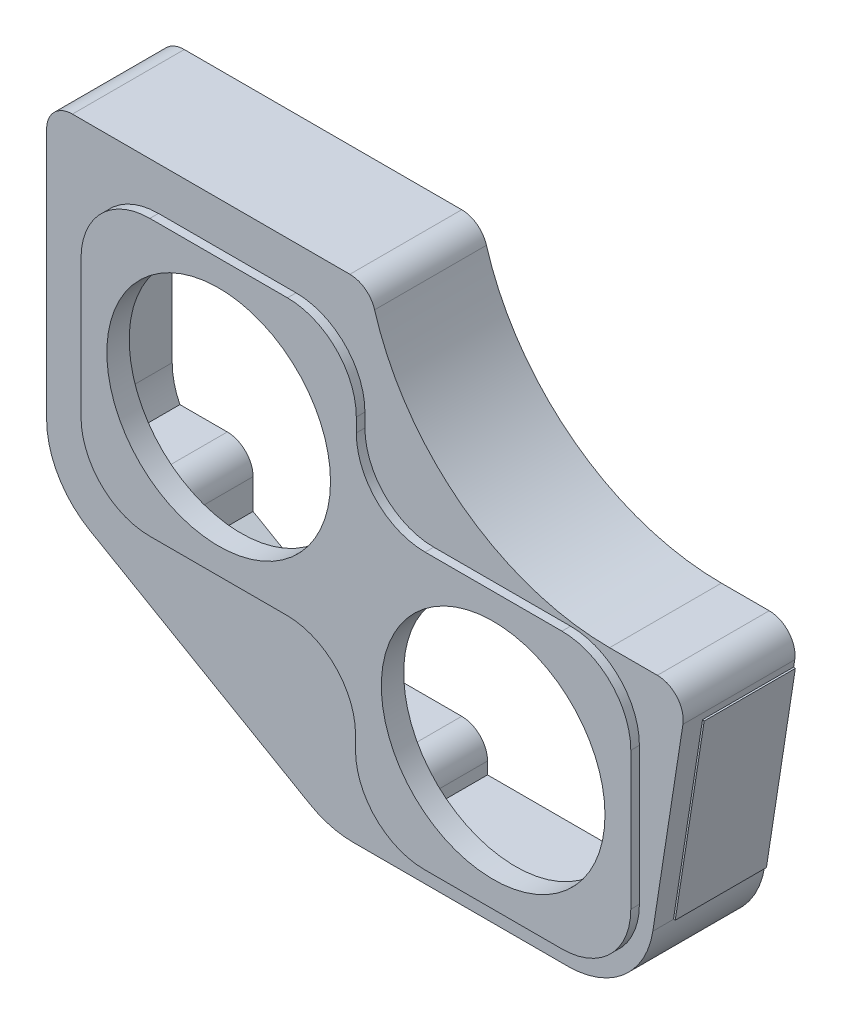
ISO-10303-21;
HEADER;
FILE_DESCRIPTION(('STEP AP214'),'2;1');
FILE_NAME('part.step','',(''),(''),'','','');
FILE_SCHEMA(('AUTOMOTIVE_DESIGN { 1 0 10303 214 1 1 1 1 }'));
ENDSEC;
DATA;
#1=APPLICATION_CONTEXT('core data for automotive mechanical design processes');
#2=APPLICATION_PROTOCOL_DEFINITION('international standard','automotive_design',2000,#1);
#3=PRODUCT_CONTEXT('',#1,'mechanical');
#4=PRODUCT('Part','Part','',(#3));
#5=PRODUCT_RELATED_PRODUCT_CATEGORY('part','',(#4));
#6=PRODUCT_DEFINITION_FORMATION('','',#4);
#7=PRODUCT_DEFINITION_CONTEXT('part definition',#1,'design');
#8=PRODUCT_DEFINITION('design','',#6,#7);
#9=PRODUCT_DEFINITION_SHAPE('','',#8);
#10=(LENGTH_UNIT() NAMED_UNIT(*) SI_UNIT(.MILLI.,.METRE.));
#11=(NAMED_UNIT(*) PLANE_ANGLE_UNIT() SI_UNIT($,.RADIAN.));
#12=(NAMED_UNIT(*) SI_UNIT($,.STERADIAN.) SOLID_ANGLE_UNIT());
#13=UNCERTAINTY_MEASURE_WITH_UNIT(LENGTH_MEASURE(1.E-05),#10,'distance_accuracy_value','');
#14=(GEOMETRIC_REPRESENTATION_CONTEXT(3) GLOBAL_UNCERTAINTY_ASSIGNED_CONTEXT((#13)) GLOBAL_UNIT_ASSIGNED_CONTEXT((#10,
#11,#12)) REPRESENTATION_CONTEXT('',''));
#15=CARTESIAN_POINT('',(0.,0.,0.));
#16=DIRECTION('',(0.,0.,1.));
#17=DIRECTION('',(1.,0.,0.));
#18=AXIS2_PLACEMENT_3D('',#15,#16,#17);
#19=CARTESIAN_POINT('',(264.823349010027,-24.7952830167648,-68.));
#20=DIRECTION('',(0.98822326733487,-0.153018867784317,0.));
#21=DIRECTION('',(0.153018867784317,0.98822326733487,0.));
#22=AXIS2_PLACEMENT_3D('',#19,#20,#21);
#23=PLANE('',#22);
#24=DIRECTION('',(0.153018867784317,0.98822326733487,0.));
#25=VECTOR('',#24,1.);
#26=CARTESIAN_POINT('',(264.823349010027,-24.7952830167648,-65.));
#27=LINE('',#26,#25);
#28=CARTESIAN_POINT('',(247.348507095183,-137.650943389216,-65.));
#29=VERTEX_POINT('',#28);
#30=CARTESIAN_POINT('',(247.379198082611,-137.45273549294,-65.));
#31=VERTEX_POINT('',#30);
#32=EDGE_CURVE('E380',#29,#31,#27,.T.);
#33=ORIENTED_EDGE('',*,*,#32,.T.);
#34=DIRECTION('',(0.,0.,-1.));
#35=VECTOR('',#34,1.);
#36=CARTESIAN_POINT('',(247.379198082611,-137.45273549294,-11.9999999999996));
#37=LINE('',#36,#35);
#38=CARTESIAN_POINT('',(247.379198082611,-137.45273549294,-11.9999999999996));
#39=VERTEX_POINT('',#38);
#40=EDGE_CURVE('E39',#39,#31,#37,.T.);
#41=ORIENTED_EDGE('',*,*,#40,.F.);
#42=DIRECTION('',(-0.153018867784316,-0.98822326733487,0.));
#43=VECTOR('',#42,1.);
#44=CARTESIAN_POINT('',(264.211273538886,-28.7481760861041,-11.9999999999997));
#45=LINE('',#44,#43);
#46=CARTESIAN_POINT('',(264.211273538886,-28.7481760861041,-11.9999999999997));
#47=VERTEX_POINT('',#46);
#48=EDGE_CURVE('E34',#47,#39,#45,.T.);
#49=ORIENTED_EDGE('',*,*,#48,.F.);
#50=DIRECTION('',(0.,0.,1.));
#51=VECTOR('',#50,1.);
#52=CARTESIAN_POINT('',(264.21127353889,-28.7481760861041,-65.));
#53=LINE('',#52,#51);
#54=CARTESIAN_POINT('',(264.21127353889,-28.7481760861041,-65.));
#55=VERTEX_POINT('',#54);
#56=EDGE_CURVE('E383',#55,#47,#53,.T.);
#57=ORIENTED_EDGE('',*,*,#56,.F.);
#58=CARTESIAN_POINT('',(264.823349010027,-24.7952830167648,-65.));
#59=VERTEX_POINT('',#58);
#60=EDGE_CURVE('E371',#55,#59,#27,.T.);
#61=ORIENTED_EDGE('',*,*,#60,.T.);
#62=DIRECTION('',(0.,0.,1.));
#63=VECTOR('',#62,1.);
#64=CARTESIAN_POINT('',(264.823349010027,-24.7952830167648,-68.));
#65=LINE('',#64,#63);
#66=CARTESIAN_POINT('',(264.823349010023,-24.7952830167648,5.62050406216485E-13));
#67=VERTEX_POINT('',#66);
#68=EDGE_CURVE('E721',#59,#67,#65,.T.);
#69=ORIENTED_EDGE('',*,*,#68,.T.);
#70=DIRECTION('',(0.153018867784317,0.98822326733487,0.));
#71=VECTOR('',#70,1.);
#72=CARTESIAN_POINT('',(264.823349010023,-24.7952830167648,5.62050406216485E-13));
#73=LINE('',#72,#71);
#74=CARTESIAN_POINT('',(247.348507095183,-137.650943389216,5.62050406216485E-13));
#75=VERTEX_POINT('',#74);
#76=EDGE_CURVE('E703',#75,#67,#73,.T.);
#77=ORIENTED_EDGE('',*,*,#76,.F.);
#78=DIRECTION('',(0.,0.,1.));
#79=VECTOR('',#78,1.);
#80=CARTESIAN_POINT('',(247.348507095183,-137.650943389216,-68.));
#81=LINE('',#80,#79);
#82=EDGE_CURVE('E723',#29,#75,#81,.T.);
#83=ORIENTED_EDGE('',*,*,#82,.F.);
#84=EDGE_LOOP('',(#33,#41,#49,#57,#61,#69,#77,#83));
#85=FACE_BOUND('',#84,.T.);
#86=ADVANCED_FACE('F15',(#85),#23,.T.);
#87=CARTESIAN_POINT('',(-75.9999999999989,-92.5086519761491,-68.));
#88=DIRECTION('',(-0.5,-0.866025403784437,0.));
#89=DIRECTION('',(0.866025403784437,-0.5,0.));
#90=AXIS2_PLACEMENT_3D('',#87,#88,#89);
#91=PLANE('',#90);
#92=DIRECTION('',(0.866025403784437,-0.5,0.));
#93=VECTOR('',#92,1.);
#94=CARTESIAN_POINT('',(-75.9999999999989,-92.5086519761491,-65.));
#95=LINE('',#94,#93);
#96=CARTESIAN_POINT('',(-50.,-107.51975897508,-65.));
#97=VERTEX_POINT('',#96);
#98=CARTESIAN_POINT('',(23.5779357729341,-150.,-64.9999999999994));
#99=VERTEX_POINT('',#98);
#100=EDGE_CURVE('E435',#97,#99,#95,.T.);
#101=ORIENTED_EDGE('',*,*,#100,.F.);
#102=DIRECTION('',(0.,0.,1.));
#103=VECTOR('',#102,1.);
#104=CARTESIAN_POINT('',(-49.9999999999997,-107.51975897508,-134.440417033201));
#105=LINE('',#104,#103);
#106=CARTESIAN_POINT('',(-50.,-107.51975897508,-7.99999999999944));
#107=VERTEX_POINT('',#106);
#108=EDGE_CURVE('E556',#97,#107,#105,.T.);
#109=ORIENTED_EDGE('',*,*,#108,.T.);
#110=DIRECTION('',(0.866025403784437,-0.5,0.));
#111=VECTOR('',#110,1.);
#112=CARTESIAN_POINT('',(-44.5758605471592,-110.651387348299,-7.99999999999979));
#113=LINE('',#112,#111);
#114=CARTESIAN_POINT('',(23.5779357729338,-150.,-8.00000000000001));
#115=VERTEX_POINT('',#114);
#116=EDGE_CURVE('E665',#107,#115,#113,.T.);
#117=ORIENTED_EDGE('',*,*,#116,.T.);
#118=DIRECTION('',(0.,0.,1.));
#119=VECTOR('',#118,1.);
#120=CARTESIAN_POINT('',(23.5779357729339,-150.,-134.440417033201));
#121=LINE('',#120,#119);
#122=EDGE_CURVE('E579',#99,#115,#121,.T.);
#123=ORIENTED_EDGE('',*,*,#122,.F.);
#124=EDGE_LOOP('',(#101,#109,#117,#123));
#125=FACE_BOUND('',#124,.T.);
#126=ADVANCED_FACE('F877',(#125),#91,.F.);
#127=CARTESIAN_POINT('',(-55.0000000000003,-56.1355850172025,-68.));
#128=DIRECTION('',(0.,0.,1.));
#129=DIRECTION('',(1.,0.,0.));
#130=AXIS2_PLACEMENT_3D('',#127,#128,#129);
#131=CYLINDRICAL_SURFACE('',#130,42.);
#132=CARTESIAN_POINT('',(-55.0000000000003,-56.1355850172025,-65.));
#133=DIRECTION('',(0.,0.,-1.));
#134=DIRECTION('',(-1.,0.,0.));
#135=AXIS2_PLACEMENT_3D('',#132,#133,#134);
#136=CIRCLE('',#135,42.);
#137=CARTESIAN_POINT('',(-96.9999999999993,-56.1355850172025,-65.));
#138=VERTEX_POINT('',#137);
#139=CARTESIAN_POINT('',(-92.5251095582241,-75.0000000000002,-65.));
#140=VERTEX_POINT('',#139);
#141=EDGE_CURVE('E433',#138,#140,#136,.F.);
#142=ORIENTED_EDGE('',*,*,#141,.F.);
#143=DIRECTION('',(0.,0.,1.));
#144=VECTOR('',#143,1.);
#145=CARTESIAN_POINT('',(-96.9999999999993,-56.1355850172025,-68.));
#146=LINE('',#145,#144);
#147=CARTESIAN_POINT('',(-96.9999999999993,-56.1355850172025,-8.00000000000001));
#148=VERTEX_POINT('',#147);
#149=EDGE_CURVE('E645',#138,#148,#146,.T.);
#150=ORIENTED_EDGE('',*,*,#149,.T.);
#151=CARTESIAN_POINT('',(-55.,-56.1355850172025,-8.00000000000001));
#152=DIRECTION('',(0.,0.,1.));
#153=DIRECTION('',(1.,0.,0.));
#154=AXIS2_PLACEMENT_3D('',#151,#152,#153);
#155=CIRCLE('',#154,42.);
#156=CARTESIAN_POINT('',(-92.5251095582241,-75.0000000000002,-8.00000000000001));
#157=VERTEX_POINT('',#156);
#158=EDGE_CURVE('E668',#148,#157,#155,.T.);
#159=ORIENTED_EDGE('',*,*,#158,.T.);
#160=DIRECTION('',(0.,0.,1.));
#161=VECTOR('',#160,1.);
#162=CARTESIAN_POINT('',(-92.5251095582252,-75.0000000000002,-134.440417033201));
#163=LINE('',#162,#161);
#164=EDGE_CURVE('E562',#140,#157,#163,.T.);
#165=ORIENTED_EDGE('',*,*,#164,.F.);
#166=EDGE_LOOP('',(#142,#150,#159,#165));
#167=FACE_BOUND('',#166,.T.);
#168=ADVANCED_FACE('F882',(#167),#131,.F.);
#169=CARTESIAN_POINT('',(72.9369196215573,-172.,-68.));
#170=DIRECTION('',(0.,-1.,0.));
#171=DIRECTION('',(1.,0.,0.));
#172=AXIS2_PLACEMENT_3D('',#169,#170,#171);
#173=PLANE('',#172);
#174=DIRECTION('',(1.,0.,0.));
#175=VECTOR('',#174,1.);
#176=CARTESIAN_POINT('',(72.9369196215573,-172.,-65.));
#177=LINE('',#176,#175);
#178=CARTESIAN_POINT('',(86.270271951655,-172.,-65.));
#179=VERTEX_POINT('',#178);
#180=CARTESIAN_POINT('',(197.937343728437,-172.,-65.));
#181=VERTEX_POINT('',#180);
#182=EDGE_CURVE('E445',#179,#181,#177,.T.);
#183=ORIENTED_EDGE('',*,*,#182,.F.);
#184=DIRECTION('',(0.,0.,1.));
#185=VECTOR('',#184,1.);
#186=CARTESIAN_POINT('',(86.2702719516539,-172.,-134.440417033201));
#187=LINE('',#186,#185);
#188=CARTESIAN_POINT('',(86.2702719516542,-172.,-8.00000000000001));
#189=VERTEX_POINT('',#188);
#190=EDGE_CURVE('E573',#179,#189,#187,.T.);
#191=ORIENTED_EDGE('',*,*,#190,.T.);
#192=DIRECTION('',(1.,0.,0.));
#193=VECTOR('',#192,1.);
#194=CARTESIAN_POINT('',(71.2702719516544,-172.,-8.00000000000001));
#195=LINE('',#194,#193);
#196=CARTESIAN_POINT('',(197.937343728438,-172.,-8.00000000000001));
#197=VERTEX_POINT('',#196);
#198=EDGE_CURVE('E661',#189,#197,#195,.T.);
#199=ORIENTED_EDGE('',*,*,#198,.T.);
#200=DIRECTION('',(0.,0.,1.));
#201=VECTOR('',#200,1.);
#202=CARTESIAN_POINT('',(197.937343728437,-172.,-68.));
#203=LINE('',#202,#201);
#204=EDGE_CURVE('E658',#181,#197,#203,.T.);
#205=ORIENTED_EDGE('',*,*,#204,.F.);
#206=EDGE_LOOP('',(#183,#191,#199,#205));
#207=FACE_BOUND('',#206,.T.);
#208=ADVANCED_FACE('F1090',(#207),#173,.F.);
#209=CARTESIAN_POINT('',(-89.9999999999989,97.,-68.));
#210=DIRECTION('',(0.,1.,0.));
#211=DIRECTION('',(-1.,0.,0.));
#212=AXIS2_PLACEMENT_3D('',#209,#210,#211);
#213=PLANE('',#212);
#214=DIRECTION('',(-1.,0.,0.));
#215=VECTOR('',#214,1.);
#216=CARTESIAN_POINT('',(-89.9999999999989,97.,-65.));
#217=LINE('',#216,#215);
#218=CARTESIAN_POINT('',(38.770271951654,97.,-65.));
#219=VERTEX_POINT('',#218);
#220=CARTESIAN_POINT('',(-76.7335008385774,97.,-65.));
#221=VERTEX_POINT('',#220);
#222=EDGE_CURVE('E453',#219,#221,#217,.T.);
#223=ORIENTED_EDGE('',*,*,#222,.F.);
#224=DIRECTION('',(0.,0.,1.));
#225=VECTOR('',#224,1.);
#226=CARTESIAN_POINT('',(38.7702719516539,97.,-134.440417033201));
#227=LINE('',#226,#225);
#228=CARTESIAN_POINT('',(38.7702719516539,97.,-7.99999999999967));
#229=VERTEX_POINT('',#228);
#230=EDGE_CURVE('E590',#219,#229,#227,.T.);
#231=ORIENTED_EDGE('',*,*,#230,.T.);
#232=DIRECTION('',(-1.,0.,0.));
#233=VECTOR('',#232,1.);
#234=CARTESIAN_POINT('',(71.2702719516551,97.,-7.99999999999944));
#235=LINE('',#234,#233);
#236=CARTESIAN_POINT('',(-76.7335008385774,97.,-7.99999999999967));
#237=VERTEX_POINT('',#236);
#238=EDGE_CURVE('E641',#229,#237,#235,.T.);
#239=ORIENTED_EDGE('',*,*,#238,.T.);
#240=DIRECTION('',(0.,0.,1.));
#241=VECTOR('',#240,1.);
#242=CARTESIAN_POINT('',(-76.7335008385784,97.,-134.440417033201));
#243=LINE('',#242,#241);
#244=EDGE_CURVE('E603',#221,#237,#243,.T.);
#245=ORIENTED_EDGE('',*,*,#244,.F.);
#246=EDGE_LOOP('',(#223,#231,#239,#245));
#247=FACE_BOUND('',#246,.T.);
#248=ADVANCED_FACE('F1051',(#247),#213,.F.);
#249=CARTESIAN_POINT('',(222.204860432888,135.,-68.));
#250=DIRECTION('',(0.,0.,1.));
#251=DIRECTION('',(1.,0.,0.));
#252=AXIS2_PLACEMENT_3D('',#249,#250,#251);
#253=CYLINDRICAL_SURFACE('',#252,150.5);
#254=CARTESIAN_POINT('',(222.204860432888,135.,-65.));
#255=DIRECTION('',(0.,0.,-1.));
#256=DIRECTION('',(-1.,0.,0.));
#257=AXIS2_PLACEMENT_3D('',#254,#255,#256);
#258=CIRCLE('',#257,150.5);
#259=CARTESIAN_POINT('',(222.204860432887,-15.4999999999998,-65.));
#260=VERTEX_POINT('',#259);
#261=CARTESIAN_POINT('',(84.1822173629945,75.0000000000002,-64.9999999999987));
#262=VERTEX_POINT('',#261);
#263=EDGE_CURVE('E461',#260,#262,#258,.T.);
#264=ORIENTED_EDGE('',*,*,#263,.F.);
#265=DIRECTION('',(0.,0.,1.));
#266=VECTOR('',#265,1.);
#267=CARTESIAN_POINT('',(222.204860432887,-15.4999999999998,-68.));
#268=LINE('',#267,#266);
#269=CARTESIAN_POINT('',(222.204860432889,-15.4999999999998,-8.00000000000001));
#270=VERTEX_POINT('',#269);
#271=EDGE_CURVE('E647',#260,#270,#268,.T.);
#272=ORIENTED_EDGE('',*,*,#271,.T.);
#273=CARTESIAN_POINT('',(222.204860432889,135.,-7.99999999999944));
#274=DIRECTION('',(0.,0.,1.));
#275=DIRECTION('',(1.,0.,0.));
#276=AXIS2_PLACEMENT_3D('',#273,#274,#275);
#277=CIRCLE('',#276,150.5);
#278=CARTESIAN_POINT('',(84.1822173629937,75.0000000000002,-8.00000000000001));
#279=VERTEX_POINT('',#278);
#280=EDGE_CURVE('E642',#270,#279,#277,.F.);
#281=ORIENTED_EDGE('',*,*,#280,.T.);
#282=DIRECTION('',(0.,0.,1.));
#283=VECTOR('',#282,1.);
#284=CARTESIAN_POINT('',(84.1822173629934,74.9999999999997,-134.440417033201));
#285=LINE('',#284,#283);
#286=EDGE_CURVE('E596',#262,#279,#285,.T.);
#287=ORIENTED_EDGE('',*,*,#286,.F.);
#288=EDGE_LOOP('',(#264,#272,#281,#287));
#289=FACE_BOUND('',#288,.T.);
#290=ADVANCED_FACE('F1037',(#289),#253,.T.);
#291=CARTESIAN_POINT('',(-96.9999999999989,89.9999999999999,-68.));
#292=DIRECTION('',(-1.,0.,0.));
#293=DIRECTION('',(0.,-1.,0.));
#294=AXIS2_PLACEMENT_3D('',#291,#292,#293);
#295=PLANE('',#294);
#296=DIRECTION('',(0.,-1.,0.));
#297=VECTOR('',#296,1.);
#298=CARTESIAN_POINT('',(-96.9999999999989,89.9999999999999,-65.));
#299=LINE('',#298,#297);
#300=CARTESIAN_POINT('',(-96.9999999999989,76.7335008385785,-65.));
#301=VERTEX_POINT('',#300);
#302=EDGE_CURVE('E443',#301,#138,#299,.T.);
#303=ORIENTED_EDGE('',*,*,#302,.F.);
#304=DIRECTION('',(0.,0.,1.));
#305=VECTOR('',#304,1.);
#306=CARTESIAN_POINT('',(-97.,76.7335008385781,-134.440417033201));
#307=LINE('',#306,#305);
#308=CARTESIAN_POINT('',(-96.9999999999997,76.7335008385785,-8.00000000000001));
#309=VERTEX_POINT('',#308);
#310=EDGE_CURVE('E601',#301,#309,#307,.T.);
#311=ORIENTED_EDGE('',*,*,#310,.T.);
#312=DIRECTION('',(0.,-1.,0.));
#313=VECTOR('',#312,1.);
#314=CARTESIAN_POINT('',(-96.9999999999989,89.9999999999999,-8.00000000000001));
#315=LINE('',#314,#313);
#316=EDGE_CURVE('E671',#309,#148,#315,.T.);
#317=ORIENTED_EDGE('',*,*,#316,.T.);
#318=ORIENTED_EDGE('',*,*,#149,.F.);
#319=EDGE_LOOP('',(#303,#311,#317,#318));
#320=FACE_BOUND('',#319,.T.);
#321=ADVANCED_FACE('F1058',(#320),#295,.F.);
#322=CARTESIAN_POINT('',(222.204860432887,-15.4999999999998,-68.));
#323=DIRECTION('',(0.,1.,0.));
#324=DIRECTION('',(0.,0.,1.));
#325=AXIS2_PLACEMENT_3D('',#322,#323,#324);
#326=PLANE('',#325);
#327=DIRECTION('',(-1.,0.,0.));
#328=VECTOR('',#327,1.);
#329=CARTESIAN_POINT('',(222.204860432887,-15.4999999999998,-65.));
#330=LINE('',#329,#328);
#331=CARTESIAN_POINT('',(236.733500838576,-15.4999999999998,-65.));
#332=VERTEX_POINT('',#331);
#333=EDGE_CURVE('E459',#332,#260,#330,.T.);
#334=ORIENTED_EDGE('',*,*,#333,.F.);
#335=DIRECTION('',(0.,0.,1.));
#336=VECTOR('',#335,1.);
#337=CARTESIAN_POINT('',(236.733500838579,-15.5000000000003,-134.440417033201));
#338=LINE('',#337,#336);
#339=CARTESIAN_POINT('',(236.733500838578,-15.4999999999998,-8.00000000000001));
#340=VERTEX_POINT('',#339);
#341=EDGE_CURVE('E608',#332,#340,#338,.T.);
#342=ORIENTED_EDGE('',*,*,#341,.T.);
#343=DIRECTION('',(-1.,0.,0.));
#344=VECTOR('',#343,1.);
#345=CARTESIAN_POINT('',(71.270271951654,-15.4999999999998,-8.00000000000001));
#346=LINE('',#345,#344);
#347=EDGE_CURVE('E646',#340,#270,#346,.T.);
#348=ORIENTED_EDGE('',*,*,#347,.T.);
#349=ORIENTED_EDGE('',*,*,#271,.F.);
#350=EDGE_LOOP('',(#334,#342,#348,#349));
#351=FACE_BOUND('',#350,.T.);
#352=ADVANCED_FACE('F1017',(#351),#326,.F.);
#353=CARTESIAN_POINT('',(256.917562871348,-23.57113207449,-68.));
#354=DIRECTION('',(0.98822326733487,-0.153018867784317,0.));
#355=DIRECTION('',(0.153018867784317,0.98822326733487,0.));
#356=AXIS2_PLACEMENT_3D('',#353,#354,#355);
#357=PLANE('',#356);
#358=CARTESIAN_POINT('',(240.621053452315,-128.816910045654,-19.9999999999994));
#359=DIRECTION('',(0.98822326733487,-0.153018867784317,0.));
#360=DIRECTION('',(0.153018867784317,0.98822326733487,0.));
#361=AXIS2_PLACEMENT_3D('',#358,#359,#360);
#362=CIRCLE('',#361,2.5);
#363=CARTESIAN_POINT('',(241.003600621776,-126.346351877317,-19.9999999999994));
#364=VERTEX_POINT('',#363);
#365=EDGE_CURVE('E417',#364,#364,#362,.T.);
#366=ORIENTED_EDGE('',*,*,#365,.T.);
#367=EDGE_LOOP('',(#366));
#368=FACE_BOUND('',#367,.T.);
#369=CARTESIAN_POINT('',(240.621053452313,-128.816910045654,-57.));
#370=DIRECTION('',(0.98822326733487,-0.153018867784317,0.));
#371=DIRECTION('',(0.153018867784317,0.98822326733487,0.));
#372=AXIS2_PLACEMENT_3D('',#369,#370,#371);
#373=CIRCLE('',#372,2.5);
#374=CARTESIAN_POINT('',(241.003600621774,-126.346351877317,-57.));
#375=VERTEX_POINT('',#374);
#376=EDGE_CURVE('E420',#375,#375,#373,.T.);
#377=ORIENTED_EDGE('',*,*,#376,.T.);
#378=EDGE_LOOP('',(#377));
#379=FACE_BOUND('',#378,.T.);
#380=DIRECTION('',(0.,0.,1.));
#381=VECTOR('',#380,1.);
#382=CARTESIAN_POINT('',(254.887538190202,-36.6813952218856,-134.440417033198));
#383=LINE('',#382,#381);
#384=CARTESIAN_POINT('',(254.887538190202,-36.6813952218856,-18.2309661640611));
#385=VERTEX_POINT('',#384);
#386=CARTESIAN_POINT('',(254.887538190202,-36.6813952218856,-8.00000000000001));
#387=VERTEX_POINT('',#386);
#388=EDGE_CURVE('E610',#385,#387,#383,.T.);
#389=ORIENTED_EDGE('',*,*,#388,.F.);
#390=CARTESIAN_POINT('',(255.157845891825,-34.935699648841,-20.));
#391=DIRECTION('',(0.98822326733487,-0.153018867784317,0.));
#392=DIRECTION('',(0.153018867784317,0.98822326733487,0.));
#393=AXIS2_PLACEMENT_3D('',#390,#391,#392);
#394=CIRCLE('',#393,2.5);
#395=CARTESIAN_POINT('',(254.887538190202,-36.6813952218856,-21.7690338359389));
#396=VERTEX_POINT('',#395);
#397=EDGE_CURVE('E414',#385,#396,#394,.T.);
#398=ORIENTED_EDGE('',*,*,#397,.T.);
#399=CARTESIAN_POINT('',(254.887538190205,-36.6813952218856,-55.2309661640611));
#400=VERTEX_POINT('',#399);
#401=EDGE_CURVE('E615',#400,#396,#383,.T.);
#402=ORIENTED_EDGE('',*,*,#401,.F.);
#403=CARTESIAN_POINT('',(255.157845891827,-34.935699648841,-57.));
#404=DIRECTION('',(0.98822326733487,-0.153018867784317,0.));
#405=DIRECTION('',(0.153018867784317,0.98822326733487,0.));
#406=AXIS2_PLACEMENT_3D('',#403,#404,#405);
#407=CIRCLE('',#406,2.5);
#408=CARTESIAN_POINT('',(254.887538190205,-36.6813952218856,-58.7690338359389));
#409=VERTEX_POINT('',#408);
#410=EDGE_CURVE('E426',#400,#409,#407,.T.);
#411=ORIENTED_EDGE('',*,*,#410,.T.);
#412=CARTESIAN_POINT('',(254.887538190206,-36.6813952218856,-65.));
#413=VERTEX_POINT('',#412);
#414=EDGE_CURVE('E611',#413,#409,#383,.T.);
#415=ORIENTED_EDGE('',*,*,#414,.F.);
#416=DIRECTION('',(0.153018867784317,0.98822326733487,0.));
#417=VECTOR('',#416,1.);
#418=CARTESIAN_POINT('',(256.917562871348,-23.57113207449,-65.));
#419=LINE('',#418,#417);
#420=CARTESIAN_POINT('',(239.442720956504,-136.426792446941,-65.));
#421=VERTEX_POINT('',#420);
#422=EDGE_CURVE('E451',#421,#413,#419,.T.);
#423=ORIENTED_EDGE('',*,*,#422,.F.);
#424=DIRECTION('',(0.,0.,1.));
#425=VECTOR('',#424,1.);
#426=CARTESIAN_POINT('',(239.442720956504,-136.426792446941,-68.));
#427=LINE('',#426,#425);
#428=CARTESIAN_POINT('',(239.442720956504,-136.426792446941,-7.99999999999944));
#429=VERTEX_POINT('',#428);
#430=EDGE_CURVE('E650',#421,#429,#427,.T.);
#431=ORIENTED_EDGE('',*,*,#430,.T.);
#432=DIRECTION('',(0.153018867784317,0.98822326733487,0.));
#433=VECTOR('',#432,1.);
#434=CARTESIAN_POINT('',(269.744537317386,59.2677673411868,-7.99999999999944));
#435=LINE('',#434,#433);
#436=EDGE_CURVE('E653',#429,#387,#435,.T.);
#437=ORIENTED_EDGE('',*,*,#436,.T.);
#438=EDGE_LOOP('',(#389,#398,#402,#411,#415,#423,#431,#437));
#439=FACE_BOUND('',#438,.T.);
#440=ADVANCED_FACE('F1014',(#368,#379,#439),#357,.F.);
#441=CARTESIAN_POINT('',(71.2702719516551,89.9999999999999,-68.));
#442=DIRECTION('',(0.,0.,1.));
#443=DIRECTION('',(1.,0.,0.));
#444=AXIS2_PLACEMENT_3D('',#441,#442,#443);
#445=CYLINDRICAL_SURFACE('',#444,15.);
#446=DIRECTION('',(0.,0.,1.));
#447=VECTOR('',#446,1.);
#448=CARTESIAN_POINT('',(85.6449946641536,94.2857142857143,-68.));
#449=LINE('',#448,#447);
#450=CARTESIAN_POINT('',(85.6449946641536,94.2857142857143,-65.));
#451=VERTEX_POINT('',#450);
#452=CARTESIAN_POINT('',(85.6449946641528,94.2857142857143,2.22044604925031E-13));
#453=VERTEX_POINT('',#452);
#454=EDGE_CURVE('E638',#451,#453,#449,.T.);
#455=ORIENTED_EDGE('',*,*,#454,.F.);
#456=CARTESIAN_POINT('',(71.2702719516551,89.9999999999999,-65.));
#457=DIRECTION('',(0.,0.,-1.));
#458=DIRECTION('',(-1.,0.,0.));
#459=AXIS2_PLACEMENT_3D('',#456,#457,#458);
#460=CIRCLE('',#459,15.);
#461=CARTESIAN_POINT('',(71.2702719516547,105.,-65.));
#462=VERTEX_POINT('',#461);
#463=EDGE_CURVE('E497',#451,#462,#460,.F.);
#464=ORIENTED_EDGE('',*,*,#463,.T.);
#465=DIRECTION('',(0.,0.,1.));
#466=VECTOR('',#465,1.);
#467=CARTESIAN_POINT('',(71.2702719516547,105.,-68.));
#468=LINE('',#467,#466);
#469=CARTESIAN_POINT('',(71.2702719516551,105.,5.62050406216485E-13));
#470=VERTEX_POINT('',#469);
#471=EDGE_CURVE('E715',#462,#470,#468,.T.);
#472=ORIENTED_EDGE('',*,*,#471,.T.);
#473=CARTESIAN_POINT('',(71.2702719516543,89.9999999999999,5.62050406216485E-13));
#474=DIRECTION('',(0.,0.,1.));
#475=DIRECTION('',(1.,0.,0.));
#476=AXIS2_PLACEMENT_3D('',#473,#474,#475);
#477=CIRCLE('',#476,15.);
#478=EDGE_CURVE('E649',#453,#470,#477,.T.);
#479=ORIENTED_EDGE('',*,*,#478,.F.);
#480=EDGE_LOOP('',(#455,#464,#472,#479));
#481=FACE_BOUND('',#480,.T.);
#482=ADVANCED_FACE('F17',(#481),#445,.T.);
#483=CARTESIAN_POINT('',(222.204860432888,135.,-68.));
#484=DIRECTION('',(0.,0.,1.));
#485=DIRECTION('',(1.,0.,0.));
#486=AXIS2_PLACEMENT_3D('',#483,#484,#485);
#487=CYLINDRICAL_SURFACE('',#486,142.5);
#488=DIRECTION('',(0.,0.,1.));
#489=VECTOR('',#488,1.);
#490=CARTESIAN_POINT('',(222.204860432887,-7.49999999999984,-68.));
#491=LINE('',#490,#489);
#492=CARTESIAN_POINT('',(222.204860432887,-7.49999999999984,-65.));
#493=VERTEX_POINT('',#492);
#494=CARTESIAN_POINT('',(222.204860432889,-7.49999999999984,0.));
#495=VERTEX_POINT('',#494);
#496=EDGE_CURVE('E717',#493,#495,#491,.T.);
#497=ORIENTED_EDGE('',*,*,#496,.F.);
#498=CARTESIAN_POINT('',(222.204860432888,135.,-65.));
#499=DIRECTION('',(0.,0.,-1.));
#500=DIRECTION('',(-1.,0.,0.));
#501=AXIS2_PLACEMENT_3D('',#498,#499,#500);
#502=CIRCLE('',#501,142.5);
#503=EDGE_CURVE('E494',#493,#451,#502,.T.);
#504=ORIENTED_EDGE('',*,*,#503,.T.);
#505=ORIENTED_EDGE('',*,*,#454,.T.);
#506=CARTESIAN_POINT('',(222.204860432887,135.,5.62050406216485E-13));
#507=DIRECTION('',(0.,0.,-1.));
#508=DIRECTION('',(1.,0.,0.));
#509=AXIS2_PLACEMENT_3D('',#506,#507,#508);
#510=CIRCLE('',#509,142.5);
#511=EDGE_CURVE('E712',#495,#453,#510,.T.);
#512=ORIENTED_EDGE('',*,*,#511,.F.);
#513=EDGE_LOOP('',(#497,#504,#505,#512));
#514=FACE_BOUND('',#513,.T.);
#515=ADVANCED_FACE('F932',(#514),#487,.F.);
#516=CARTESIAN_POINT('',(222.204860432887,-7.49999999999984,-68.));
#517=DIRECTION('',(0.,1.,0.));
#518=DIRECTION('',(0.,0.,1.));
#519=AXIS2_PLACEMENT_3D('',#516,#517,#518);
#520=PLANE('',#519);
#521=DIRECTION('',(0.,0.,1.));
#522=VECTOR('',#521,1.);
#523=CARTESIAN_POINT('',(249.999999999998,-7.49999999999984,-68.));
#524=LINE('',#523,#522);
#525=CARTESIAN_POINT('',(249.999999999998,-7.49999999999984,-65.));
#526=VERTEX_POINT('',#525);
#527=CARTESIAN_POINT('',(249.999999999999,-7.49999999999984,0.));
#528=VERTEX_POINT('',#527);
#529=EDGE_CURVE('E719',#526,#528,#524,.T.);
#530=ORIENTED_EDGE('',*,*,#529,.F.);
#531=DIRECTION('',(-1.,0.,0.));
#532=VECTOR('',#531,1.);
#533=CARTESIAN_POINT('',(222.204860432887,-7.49999999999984,-65.));
#534=LINE('',#533,#532);
#535=EDGE_CURVE('E491',#526,#493,#534,.T.);
#536=ORIENTED_EDGE('',*,*,#535,.T.);
#537=ORIENTED_EDGE('',*,*,#496,.T.);
#538=DIRECTION('',(-1.,0.,0.));
#539=VECTOR('',#538,1.);
#540=CARTESIAN_POINT('',(222.204860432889,-7.49999999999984,0.));
#541=LINE('',#540,#539);
#542=EDGE_CURVE('E709',#528,#495,#541,.T.);
#543=ORIENTED_EDGE('',*,*,#542,.F.);
#544=EDGE_LOOP('',(#530,#536,#537,#543));
#545=FACE_BOUND('',#544,.T.);
#546=ADVANCED_FACE('F937',(#545),#520,.T.);
#547=CARTESIAN_POINT('',(249.999999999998,-22.5,-68.));
#548=DIRECTION('',(0.,0.,1.));
#549=DIRECTION('',(1.,0.,0.));
#550=AXIS2_PLACEMENT_3D('',#547,#548,#549);
#551=CYLINDRICAL_SURFACE('',#550,15.);
#552=ORIENTED_EDGE('',*,*,#68,.F.);
#553=CARTESIAN_POINT('',(249.999999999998,-22.5,-65.));
#554=DIRECTION('',(0.,0.,-1.));
#555=DIRECTION('',(-1.,0.,0.));
#556=AXIS2_PLACEMENT_3D('',#553,#554,#555);
#557=CIRCLE('',#556,15.);
#558=EDGE_CURVE('E378',#59,#526,#557,.F.);
#559=ORIENTED_EDGE('',*,*,#558,.T.);
#560=ORIENTED_EDGE('',*,*,#529,.T.);
#561=CARTESIAN_POINT('',(249.999999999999,-22.5,5.62050406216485E-13));
#562=DIRECTION('',(0.,0.,1.));
#563=DIRECTION('',(1.,0.,0.));
#564=AXIS2_PLACEMENT_3D('',#561,#562,#563);
#565=CIRCLE('',#564,15.);
#566=EDGE_CURVE('E706',#67,#528,#565,.T.);
#567=ORIENTED_EDGE('',*,*,#566,.F.);
#568=EDGE_LOOP('',(#552,#559,#560,#567));
#569=FACE_BOUND('',#568,.T.);
#570=ADVANCED_FACE('F887',(#569),#551,.T.);
#571=CARTESIAN_POINT('',(197.937343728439,-130.,-68.));
#572=DIRECTION('',(0.,0.,1.));
#573=DIRECTION('',(1.,0.,0.));
#574=AXIS2_PLACEMENT_3D('',#571,#572,#573);
#575=CYLINDRICAL_SURFACE('',#574,50.);
#576=DIRECTION('',(0.,0.,1.));
#577=VECTOR('',#576,1.);
#578=CARTESIAN_POINT('',(197.937343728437,-180.,-68.));
#579=LINE('',#578,#577);
#580=CARTESIAN_POINT('',(197.937343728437,-180.,-65.));
#581=VERTEX_POINT('',#580);
#582=CARTESIAN_POINT('',(197.937343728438,-180.,0.));
#583=VERTEX_POINT('',#582);
#584=EDGE_CURVE('E725',#581,#583,#579,.T.);
#585=ORIENTED_EDGE('',*,*,#584,.F.);
#586=CARTESIAN_POINT('',(197.937343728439,-130.,-65.));
#587=DIRECTION('',(0.,0.,-1.));
#588=DIRECTION('',(-1.,0.,0.));
#589=AXIS2_PLACEMENT_3D('',#586,#587,#588);
#590=CIRCLE('',#589,50.);
#591=EDGE_CURVE('E381',#581,#29,#590,.F.);
#592=ORIENTED_EDGE('',*,*,#591,.T.);
#593=ORIENTED_EDGE('',*,*,#82,.T.);
#594=CARTESIAN_POINT('',(197.937343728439,-130.,5.62050406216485E-13));
#595=DIRECTION('',(0.,0.,1.));
#596=DIRECTION('',(-1.,0.,0.));
#597=AXIS2_PLACEMENT_3D('',#594,#595,#596);
#598=CIRCLE('',#597,50.);
#599=EDGE_CURVE('E700',#583,#75,#598,.T.);
#600=ORIENTED_EDGE('',*,*,#599,.F.);
#601=EDGE_LOOP('',(#585,#592,#593,#600));
#602=FACE_BOUND('',#601,.T.);
#603=ADVANCED_FACE('F889',(#602),#575,.T.);
#604=CARTESIAN_POINT('',(72.9369196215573,-180.,-68.));
#605=DIRECTION('',(0.,-1.,0.));
#606=DIRECTION('',(1.,0.,0.));
#607=AXIS2_PLACEMENT_3D('',#604,#605,#606);
#608=PLANE('',#607);
#609=DIRECTION('',(0.,0.,1.));
#610=VECTOR('',#609,1.);
#611=CARTESIAN_POINT('',(72.9369196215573,-180.,-68.));
#612=LINE('',#611,#610);
#613=CARTESIAN_POINT('',(72.9369196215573,-180.,-65.));
#614=VERTEX_POINT('',#613);
#615=CARTESIAN_POINT('',(72.9369196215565,-180.,0.));
#616=VERTEX_POINT('',#615);
#617=EDGE_CURVE('E727',#614,#616,#612,.T.);
#618=ORIENTED_EDGE('',*,*,#617,.F.);
#619=DIRECTION('',(1.,0.,0.));
#620=VECTOR('',#619,1.);
#621=CARTESIAN_POINT('',(72.9369196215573,-180.,-65.));
#622=LINE('',#621,#620);
#623=EDGE_CURVE('E485',#614,#581,#622,.T.);
#624=ORIENTED_EDGE('',*,*,#623,.T.);
#625=ORIENTED_EDGE('',*,*,#584,.T.);
#626=DIRECTION('',(1.,0.,0.));
#627=VECTOR('',#626,1.);
#628=CARTESIAN_POINT('',(72.9369196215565,-180.,0.));
#629=LINE('',#628,#627);
#630=EDGE_CURVE('E697',#616,#583,#629,.T.);
#631=ORIENTED_EDGE('',*,*,#630,.F.);
#632=EDGE_LOOP('',(#618,#624,#625,#631));
#633=FACE_BOUND('',#632,.T.);
#634=ADVANCED_FACE('F892',(#633),#608,.T.);
#635=CARTESIAN_POINT('',(72.9369196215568,-130.,-68.));
#636=DIRECTION('',(0.,0.,1.));
#637=DIRECTION('',(1.,0.,0.));
#638=AXIS2_PLACEMENT_3D('',#635,#636,#637);
#639=CYLINDRICAL_SURFACE('',#638,50.);
#640=DIRECTION('',(0.,0.,1.));
#641=VECTOR('',#640,1.);
#642=CARTESIAN_POINT('',(47.9369196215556,-173.301270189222,-68.));
#643=LINE('',#642,#641);
#644=CARTESIAN_POINT('',(47.9369196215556,-173.301270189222,-65.));
#645=VERTEX_POINT('',#644);
#646=CARTESIAN_POINT('',(47.9369196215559,-173.301270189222,0.));
#647=VERTEX_POINT('',#646);
#648=EDGE_CURVE('E729',#645,#647,#643,.T.);
#649=ORIENTED_EDGE('',*,*,#648,.F.);
#650=CARTESIAN_POINT('',(72.9369196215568,-130.,-65.));
#651=DIRECTION('',(0.,0.,-1.));
#652=DIRECTION('',(-1.,0.,0.));
#653=AXIS2_PLACEMENT_3D('',#650,#651,#652);
#654=CIRCLE('',#653,50.);
#655=EDGE_CURVE('E482',#645,#614,#654,.F.);
#656=ORIENTED_EDGE('',*,*,#655,.T.);
#657=ORIENTED_EDGE('',*,*,#617,.T.);
#658=CARTESIAN_POINT('',(72.9369196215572,-130.,5.62050406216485E-13));
#659=DIRECTION('',(0.,0.,1.));
#660=DIRECTION('',(1.,0.,0.));
#661=AXIS2_PLACEMENT_3D('',#658,#659,#660);
#662=CIRCLE('',#661,50.);
#663=EDGE_CURVE('E694',#647,#616,#662,.T.);
#664=ORIENTED_EDGE('',*,*,#663,.F.);
#665=EDGE_LOOP('',(#649,#656,#657,#664));
#666=FACE_BOUND('',#665,.T.);
#667=ADVANCED_FACE('F896',(#666),#639,.T.);
#668=CARTESIAN_POINT('',(-79.9999999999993,-99.4368552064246,-68.));
#669=DIRECTION('',(-0.5,-0.866025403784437,0.));
#670=DIRECTION('',(0.866025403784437,-0.5,0.));
#671=AXIS2_PLACEMENT_3D('',#668,#669,#670);
#672=PLANE('',#671);
#673=DIRECTION('',(0.,0.,1.));
#674=VECTOR('',#673,1.);
#675=CARTESIAN_POINT('',(-79.9999999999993,-99.4368552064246,-68.));
#676=LINE('',#675,#674);
#677=CARTESIAN_POINT('',(-80.,-99.4368552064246,-65.));
#678=VERTEX_POINT('',#677);
#679=CARTESIAN_POINT('',(-80.,-99.4368552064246,5.62050406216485E-13));
#680=VERTEX_POINT('',#679);
#681=EDGE_CURVE('E731',#678,#680,#676,.T.);
#682=ORIENTED_EDGE('',*,*,#681,.F.);
#683=DIRECTION('',(0.866025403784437,-0.5,0.));
#684=VECTOR('',#683,1.);
#685=CARTESIAN_POINT('',(-80.,-99.4368552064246,-65.));
#686=LINE('',#685,#684);
#687=EDGE_CURVE('E479',#678,#645,#686,.T.);
#688=ORIENTED_EDGE('',*,*,#687,.T.);
#689=ORIENTED_EDGE('',*,*,#648,.T.);
#690=DIRECTION('',(0.866025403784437,-0.5,0.));
#691=VECTOR('',#690,1.);
#692=CARTESIAN_POINT('',(-80.,-99.4368552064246,5.62050406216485E-13));
#693=LINE('',#692,#691);
#694=EDGE_CURVE('E691',#680,#647,#693,.T.);
#695=ORIENTED_EDGE('',*,*,#694,.F.);
#696=EDGE_LOOP('',(#682,#688,#689,#695));
#697=FACE_BOUND('',#696,.T.);
#698=ADVANCED_FACE('F900',(#697),#672,.T.);
#699=CARTESIAN_POINT('',(-55.0000000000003,-56.1355850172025,-68.));
#700=DIRECTION('',(0.,0.,1.));
#701=DIRECTION('',(1.,0.,0.));
#702=AXIS2_PLACEMENT_3D('',#699,#700,#701);
#703=CYLINDRICAL_SURFACE('',#702,50.);
#704=DIRECTION('',(0.,0.,1.));
#705=VECTOR('',#704,1.);
#706=CARTESIAN_POINT('',(-104.999999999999,-56.1355850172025,-68.));
#707=LINE('',#706,#705);
#708=CARTESIAN_POINT('',(-104.999999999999,-56.1355850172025,-65.));
#709=VERTEX_POINT('',#708);
#710=CARTESIAN_POINT('',(-104.999999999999,-56.1355850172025,0.));
#711=VERTEX_POINT('',#710);
#712=EDGE_CURVE('E733',#709,#711,#707,.T.);
#713=ORIENTED_EDGE('',*,*,#712,.F.);
#714=CARTESIAN_POINT('',(-55.0000000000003,-56.1355850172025,-65.));
#715=DIRECTION('',(0.,0.,-1.));
#716=DIRECTION('',(-1.,0.,0.));
#717=AXIS2_PLACEMENT_3D('',#714,#715,#716);
#718=CIRCLE('',#717,50.);
#719=EDGE_CURVE('E476',#709,#678,#718,.F.);
#720=ORIENTED_EDGE('',*,*,#719,.T.);
#721=ORIENTED_EDGE('',*,*,#681,.T.);
#722=CARTESIAN_POINT('',(-55.0000000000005,-56.1355850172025,0.));
#723=DIRECTION('',(0.,0.,1.));
#724=DIRECTION('',(-1.,0.,0.));
#725=AXIS2_PLACEMENT_3D('',#722,#723,#724);
#726=CIRCLE('',#725,50.);
#727=EDGE_CURVE('E688',#711,#680,#726,.T.);
#728=ORIENTED_EDGE('',*,*,#727,.F.);
#729=EDGE_LOOP('',(#713,#720,#721,#728));
#730=FACE_BOUND('',#729,.T.);
#731=ADVANCED_FACE('F904',(#730),#703,.T.);
#732=CARTESIAN_POINT('',(-104.999999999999,89.9999999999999,-68.));
#733=DIRECTION('',(-1.,0.,0.));
#734=DIRECTION('',(0.,-1.,0.));
#735=AXIS2_PLACEMENT_3D('',#732,#733,#734);
#736=PLANE('',#735);
#737=DIRECTION('',(0.,0.,1.));
#738=VECTOR('',#737,1.);
#739=CARTESIAN_POINT('',(-104.999999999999,89.9999999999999,-68.));
#740=LINE('',#739,#738);
#741=CARTESIAN_POINT('',(-104.999999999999,89.9999999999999,-65.));
#742=VERTEX_POINT('',#741);
#743=CARTESIAN_POINT('',(-105.,89.9999999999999,5.62050406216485E-13));
#744=VERTEX_POINT('',#743);
#745=EDGE_CURVE('E735',#742,#744,#740,.T.);
#746=ORIENTED_EDGE('',*,*,#745,.F.);
#747=DIRECTION('',(0.,-1.,0.));
#748=VECTOR('',#747,1.);
#749=CARTESIAN_POINT('',(-104.999999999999,89.9999999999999,-65.));
#750=LINE('',#749,#748);
#751=EDGE_CURVE('E473',#742,#709,#750,.T.);
#752=ORIENTED_EDGE('',*,*,#751,.T.);
#753=ORIENTED_EDGE('',*,*,#712,.T.);
#754=DIRECTION('',(0.,-1.,0.));
#755=VECTOR('',#754,1.);
#756=CARTESIAN_POINT('',(-105.,89.9999999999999,5.62050406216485E-13));
#757=LINE('',#756,#755);
#758=EDGE_CURVE('E685',#744,#711,#757,.T.);
#759=ORIENTED_EDGE('',*,*,#758,.F.);
#760=EDGE_LOOP('',(#746,#752,#753,#759));
#761=FACE_BOUND('',#760,.T.);
#762=ADVANCED_FACE('F908',(#761),#736,.T.);
#763=CARTESIAN_POINT('',(-89.9999999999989,89.9999999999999,-68.));
#764=DIRECTION('',(0.,0.,1.));
#765=DIRECTION('',(1.,0.,0.));
#766=AXIS2_PLACEMENT_3D('',#763,#764,#765);
#767=CYLINDRICAL_SURFACE('',#766,15.);
#768=DIRECTION('',(0.,0.,1.));
#769=VECTOR('',#768,1.);
#770=CARTESIAN_POINT('',(-89.9999999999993,105.,-68.));
#771=LINE('',#770,#769);
#772=CARTESIAN_POINT('',(-89.9999999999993,105.,-65.));
#773=VERTEX_POINT('',#772);
#774=CARTESIAN_POINT('',(-89.9999999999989,105.,0.));
#775=VERTEX_POINT('',#774);
#776=EDGE_CURVE('E737',#773,#775,#771,.T.);
#777=ORIENTED_EDGE('',*,*,#776,.F.);
#778=CARTESIAN_POINT('',(-89.9999999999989,89.9999999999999,-65.));
#779=DIRECTION('',(0.,0.,-1.));
#780=DIRECTION('',(-1.,0.,0.));
#781=AXIS2_PLACEMENT_3D('',#778,#779,#780);
#782=CIRCLE('',#781,15.);
#783=EDGE_CURVE('E470',#773,#742,#782,.F.);
#784=ORIENTED_EDGE('',*,*,#783,.T.);
#785=ORIENTED_EDGE('',*,*,#745,.T.);
#786=CARTESIAN_POINT('',(-89.9999999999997,89.9999999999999,0.));
#787=DIRECTION('',(0.,0.,1.));
#788=DIRECTION('',(1.,0.,0.));
#789=AXIS2_PLACEMENT_3D('',#786,#787,#788);
#790=CIRCLE('',#789,15.);
#791=EDGE_CURVE('E682',#775,#744,#790,.T.);
#792=ORIENTED_EDGE('',*,*,#791,.F.);
#793=EDGE_LOOP('',(#777,#784,#785,#792));
#794=FACE_BOUND('',#793,.T.);
#795=ADVANCED_FACE('F912',(#794),#767,.T.);
#796=CARTESIAN_POINT('',(-89.9999999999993,105.,-68.));
#797=DIRECTION('',(0.,1.,0.));
#798=DIRECTION('',(-1.,0.,0.));
#799=AXIS2_PLACEMENT_3D('',#796,#797,#798);
#800=PLANE('',#799);
#801=ORIENTED_EDGE('',*,*,#471,.F.);
#802=DIRECTION('',(-1.,0.,0.));
#803=VECTOR('',#802,1.);
#804=CARTESIAN_POINT('',(-89.9999999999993,105.,-65.));
#805=LINE('',#804,#803);
#806=EDGE_CURVE('E467',#462,#773,#805,.T.);
#807=ORIENTED_EDGE('',*,*,#806,.T.);
#808=ORIENTED_EDGE('',*,*,#776,.T.);
#809=DIRECTION('',(-1.,0.,0.));
#810=VECTOR('',#809,1.);
#811=CARTESIAN_POINT('',(-89.9999999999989,105.,0.));
#812=LINE('',#811,#810);
#813=EDGE_CURVE('E679',#470,#775,#812,.T.);
#814=ORIENTED_EDGE('',*,*,#813,.F.);
#815=EDGE_LOOP('',(#801,#807,#808,#814));
#816=FACE_BOUND('',#815,.T.);
#817=ADVANCED_FACE('F915',(#816),#800,.T.);
#818=CARTESIAN_POINT('',(197.937343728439,-130.,-68.));
#819=DIRECTION('',(0.,0.,1.));
#820=DIRECTION('',(1.,0.,0.));
#821=AXIS2_PLACEMENT_3D('',#818,#819,#820);
#822=CYLINDRICAL_SURFACE('',#821,42.);
#823=CARTESIAN_POINT('',(197.937343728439,-130.,-65.));
#824=DIRECTION('',(0.,0.,-1.));
#825=DIRECTION('',(-1.,0.,0.));
#826=AXIS2_PLACEMENT_3D('',#823,#824,#825);
#827=CIRCLE('',#826,42.);
#828=EDGE_CURVE('E449',#181,#421,#827,.F.);
#829=ORIENTED_EDGE('',*,*,#828,.F.);
#830=ORIENTED_EDGE('',*,*,#204,.T.);
#831=CARTESIAN_POINT('',(197.937343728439,-130.,-7.99999999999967));
#832=DIRECTION('',(0.,0.,1.));
#833=DIRECTION('',(1.,0.,0.));
#834=AXIS2_PLACEMENT_3D('',#831,#832,#833);
#835=CIRCLE('',#834,42.);
#836=EDGE_CURVE('E656',#197,#429,#835,.T.);
#837=ORIENTED_EDGE('',*,*,#836,.T.);
#838=ORIENTED_EDGE('',*,*,#430,.F.);
#839=EDGE_LOOP('',(#829,#830,#837,#838));
#840=FACE_BOUND('',#839,.T.);
#841=ADVANCED_FACE('F873',(#840),#822,.F.);
#842=CARTESIAN_POINT('',(250.,-22.5,-134.440417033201));
#843=DIRECTION('',(0.,0.,1.));
#844=DIRECTION('',(1.,0.,0.));
#845=AXIS2_PLACEMENT_3D('',#842,#843,#844);
#846=CYLINDRICAL_SURFACE('',#845,15.);
#847=ORIENTED_EDGE('',*,*,#401,.T.);
#848=CARTESIAN_POINT('',(260.481509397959,-33.2302358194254,-20.));
#849=CARTESIAN_POINT('',(260.48151163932,-33.2302328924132,-20.1186218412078));
#850=CARTESIAN_POINT('',(260.47393369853,-33.2376514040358,-20.2372241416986));
#851=CARTESIAN_POINT('',(260.443962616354,-33.2668042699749,-20.4707088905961));
#852=CARTESIAN_POINT('',(260.421570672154,-33.2885374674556,-20.5855916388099));
#853=CARTESIAN_POINT('',(260.362997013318,-33.3448105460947,-20.8080389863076));
#854=CARTESIAN_POINT('',(260.326857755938,-33.3793109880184,-20.9156249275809));
#855=CARTESIAN_POINT('',(260.24214334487,-33.4590999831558,-21.1214416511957));
#856=CARTESIAN_POINT('',(260.193565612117,-33.5043907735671,-21.2196704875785));
#857=CARTESIAN_POINT('',(260.082698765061,-33.6060844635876,-21.4101060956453));
#858=CARTESIAN_POINT('',(260.019820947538,-33.6629479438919,-21.501720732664));
#859=CARTESIAN_POINT('',(259.883939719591,-33.7834395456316,-21.6720040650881));
#860=CARTESIAN_POINT('',(259.810931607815,-33.8470708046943,-21.7506667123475));
#861=CARTESIAN_POINT('',(259.620079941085,-34.0098316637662,-21.929042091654));
#862=CARTESIAN_POINT('',(259.497335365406,-34.1115442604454,-22.0211739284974));
#863=CARTESIAN_POINT('',(259.238452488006,-34.3185699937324,-22.1789469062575));
#864=CARTESIAN_POINT('',(259.10228448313,-34.4238907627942,-22.2445275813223));
#865=CARTESIAN_POINT('',(258.863637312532,-34.6016888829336,-22.3354008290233));
#866=CARTESIAN_POINT('',(258.763576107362,-34.6743694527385,-22.3668807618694));
#867=CARTESIAN_POINT('',(258.559839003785,-34.8184721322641,-22.41933780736));
#868=CARTESIAN_POINT('',(258.456161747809,-34.8898937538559,-22.4403109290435));
#869=CARTESIAN_POINT('',(258.140889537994,-35.1011771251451,-22.4889031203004));
#870=CARTESIAN_POINT('',(257.925006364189,-35.2380931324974,-22.5022119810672));
#871=CARTESIAN_POINT('',(257.550183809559,-35.4625619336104,-22.4979181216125));
#872=CARTESIAN_POINT('',(257.392713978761,-35.5529910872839,-22.4881013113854));
#873=CARTESIAN_POINT('',(257.075684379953,-35.727523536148,-22.4542496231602));
#874=CARTESIAN_POINT('',(256.916123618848,-35.8116236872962,-22.4302077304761));
#875=CARTESIAN_POINT('',(256.595379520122,-35.9734334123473,-22.369178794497));
#876=CARTESIAN_POINT('',(256.434192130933,-36.0511131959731,-22.3321351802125));
#877=CARTESIAN_POINT('',(256.111880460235,-36.1995026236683,-22.2461040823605));
#878=CARTESIAN_POINT('',(255.950756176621,-36.2702147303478,-22.1971208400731));
#879=CARTESIAN_POINT('',(255.624256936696,-36.4068354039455,-22.0858780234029));
#880=CARTESIAN_POINT('',(255.458914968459,-36.4725117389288,-22.0232371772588));
#881=CARTESIAN_POINT('',(255.130381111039,-36.5964534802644,-21.885446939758));
#882=CARTESIAN_POINT('',(254.967191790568,-36.6547106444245,-21.810283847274));
#883=CARTESIAN_POINT('',(254.726168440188,-36.7362388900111,-21.6875150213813));
#884=CARTESIAN_POINT('',(254.646660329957,-36.7623769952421,-21.6450473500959));
#885=CARTESIAN_POINT('',(254.489118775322,-36.8127440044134,-21.5564188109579));
#886=CARTESIAN_POINT('',(254.411085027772,-36.8369733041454,-21.5102587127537));
#887=CARTESIAN_POINT('',(254.257149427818,-36.8834325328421,-21.4139045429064));
#888=CARTESIAN_POINT('',(254.181243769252,-36.9056662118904,-21.3637183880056));
#889=CARTESIAN_POINT('',(254.03219909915,-36.9480918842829,-21.2586336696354));
#890=CARTESIAN_POINT('',(253.959058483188,-36.9682850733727,-21.20373790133));
#891=CARTESIAN_POINT('',(253.845200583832,-36.9988411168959,-21.1114132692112));
#892=CARTESIAN_POINT('',(253.803215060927,-37.0099055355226,-21.075779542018));
#893=CARTESIAN_POINT('',(253.721046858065,-37.0311943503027,-21.0022223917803));
#894=CARTESIAN_POINT('',(253.680864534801,-37.0414185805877,-20.9642985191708));
#895=CARTESIAN_POINT('',(253.602932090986,-37.0609233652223,-20.8859667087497));
#896=CARTESIAN_POINT('',(253.565176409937,-37.0702061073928,-20.845564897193));
#897=CARTESIAN_POINT('',(253.492751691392,-37.087737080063,-20.7618943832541));
#898=CARTESIAN_POINT('',(253.458080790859,-37.0959859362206,-20.7186274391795));
#899=CARTESIAN_POINT('',(253.387494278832,-37.1125424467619,-20.6215717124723));
#900=CARTESIAN_POINT('',(253.352293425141,-37.1206414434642,-20.5672161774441));
#901=CARTESIAN_POINT('',(253.289671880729,-37.1348588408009,-20.4539079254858));
#902=CARTESIAN_POINT('',(253.262241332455,-37.140979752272,-20.3949611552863));
#903=CARTESIAN_POINT('',(253.221929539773,-37.1498983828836,-20.2837967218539));
#904=CARTESIAN_POINT('',(253.207328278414,-37.1530935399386,-20.2322470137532));
#905=CARTESIAN_POINT('',(253.186824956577,-37.1575667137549,-20.1273760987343));
#906=CARTESIAN_POINT('',(253.180911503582,-37.158847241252,-20.074057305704));
#907=CARTESIAN_POINT('',(253.178510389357,-37.1593681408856,-19.9670448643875));
#908=CARTESIAN_POINT('',(253.182048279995,-37.1586029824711,-19.9133505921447));
#909=CARTESIAN_POINT('',(253.198137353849,-37.155100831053,-19.8073908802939));
#910=CARTESIAN_POINT('',(253.210698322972,-37.15236169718,-19.7551270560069));
#911=CARTESIAN_POINT('',(253.248442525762,-37.1440463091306,-19.6376977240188));
#912=CARTESIAN_POINT('',(253.276305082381,-37.1378600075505,-19.5734514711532));
#913=CARTESIAN_POINT('',(253.341435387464,-37.1231295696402,-19.4502183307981));
#914=CARTESIAN_POINT('',(253.378727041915,-37.1145794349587,-19.3912453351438));
#915=CARTESIAN_POINT('',(253.455446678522,-37.0966185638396,-19.2844163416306));
#916=CARTESIAN_POINT('',(253.494218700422,-37.0873979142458,-19.2360460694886));
#917=CARTESIAN_POINT('',(253.575558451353,-37.0676745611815,-19.1428631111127));
#918=CARTESIAN_POINT('',(253.618129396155,-37.0571707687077,-19.0980535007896));
#919=CARTESIAN_POINT('',(253.75014795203,-37.0239314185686,-18.9681269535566));
#920=CARTESIAN_POINT('',(253.843760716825,-36.9995001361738,-18.8876933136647));
#921=CARTESIAN_POINT('',(254.047911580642,-36.9439212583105,-18.7281573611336));
#922=CARTESIAN_POINT('',(254.159178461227,-36.9123303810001,-18.6501762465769));
#923=CARTESIAN_POINT('',(254.386529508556,-36.8447709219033,-18.5035154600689));
#924=CARTESIAN_POINT('',(254.502618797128,-36.808797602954,-18.4348460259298));
#925=CARTESIAN_POINT('',(254.738034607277,-36.7325815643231,-18.3053468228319));
#926=CARTESIAN_POINT('',(254.857367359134,-36.692330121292,-18.2445336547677));
#927=CARTESIAN_POINT('',(255.098007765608,-36.6076788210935,-18.1301079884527));
#928=CARTESIAN_POINT('',(255.21931583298,-36.5632780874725,-18.0764970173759));
#929=CARTESIAN_POINT('',(255.516349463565,-36.4500885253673,-17.9541936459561));
#930=CARTESIAN_POINT('',(255.69274163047,-36.3791066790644,-17.8891165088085));
#931=CARTESIAN_POINT('',(256.046585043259,-36.2286496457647,-17.7728691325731));
#932=CARTESIAN_POINT('',(256.224036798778,-36.1491699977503,-17.7217062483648));
#933=CARTESIAN_POINT('',(256.578303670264,-35.9819943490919,-17.6341905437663));
#934=CARTESIAN_POINT('',(256.755119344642,-35.8943156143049,-17.5978074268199));
#935=CARTESIAN_POINT('',(257.107025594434,-35.710964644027,-17.5411991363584));
#936=CARTESIAN_POINT('',(257.282117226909,-35.6152976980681,-17.5209633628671));
#937=CARTESIAN_POINT('',(257.676852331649,-35.3891654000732,-17.495692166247));
#938=CARTESIAN_POINT('',(257.895600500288,-35.2563329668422,-17.4963189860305));
#939=CARTESIAN_POINT('',(258.216635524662,-35.0500268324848,-17.5238950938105));
#940=CARTESIAN_POINT('',(258.322439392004,-34.9801009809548,-17.5375194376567));
#941=CARTESIAN_POINT('',(258.531061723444,-34.8384304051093,-17.574544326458));
#942=CARTESIAN_POINT('',(258.63388099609,-34.7666861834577,-17.5979421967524));
#943=CARTESIAN_POINT('',(258.886831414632,-34.5854904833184,-17.6700446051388));
#944=CARTESIAN_POINT('',(259.034599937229,-34.4753140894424,-17.7255629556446));
#945=CARTESIAN_POINT('',(259.317705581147,-34.2563711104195,-17.8643293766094));
#946=CARTESIAN_POINT('',(259.453058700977,-34.1476028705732,-17.9475411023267));
#947=CARTESIAN_POINT('',(259.67780501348,-33.9610833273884,-18.1220692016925));
#948=CARTESIAN_POINT('',(259.77067656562,-33.8818720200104,-18.2073179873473));
#949=CARTESIAN_POINT('',(259.943144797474,-33.731514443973,-18.3964072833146));
#950=CARTESIAN_POINT('',(260.022756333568,-33.6603591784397,-18.5002267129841));
#951=CARTESIAN_POINT('',(260.154508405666,-33.5405010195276,-18.7080463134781));
#952=CARTESIAN_POINT('',(260.20899362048,-33.4900276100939,-18.8095317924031));
#953=CARTESIAN_POINT('',(260.304341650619,-33.4006799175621,-19.023494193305));
#954=CARTESIAN_POINT('',(260.345208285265,-33.3618023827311,-19.1359680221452));
#955=CARTESIAN_POINT('',(260.412224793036,-33.2975829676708,-19.3712817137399));
#956=CARTESIAN_POINT('',(260.438099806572,-33.272494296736,-19.4942704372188));
#957=CARTESIAN_POINT('',(260.472738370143,-33.2388247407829,-19.7448478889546));
#958=CARTESIAN_POINT('',(260.481506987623,-33.2302389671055,-19.8724352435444));
#959=CARTESIAN_POINT('',(260.481509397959,-33.2302358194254,-20.));
#960=B_SPLINE_CURVE_WITH_KNOTS('',3,(#848,#849,#850,#851,#852,#853,#854,#855,#856,#857,#858,
#859,#860,#861,#862,#863,#864,#865,#866,#867,#868,#869,#870,#871,#872,#873,#874,#875,#876,#877,
#878,#879,#880,#881,#882,#883,#884,#885,#886,#887,#888,#889,#890,#891,#892,#893,#894,#895,#896,
#897,#898,#899,#900,#901,#902,#903,#904,#905,#906,#907,#908,#909,#910,#911,#912,#913,#914,#915,
#916,#917,#918,#919,#920,#921,#922,#923,#924,#925,#926,#927,#928,#929,#930,#931,#932,#933,#934,
#935,#936,#937,#938,#939,#940,#941,#942,#943,#944,#945,#946,#947,#948,#949,#950,#951,#952,#953,
#954,#955,#956,#957,#958,#959),.UNSPECIFIED.,.T.,.F.,(4,2,2,2,2,2,2,2,2,2,2,2,2,2,2,2,2,2,2,2,2,
2,2,2,2,2,2,2,2,2,2,2,2,2,2,2,2,2,2,2,2,2,2,2,2,2,2,2,2,2,2,2,2,2,2,4),(0.,0.355370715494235,
0.710712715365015,1.06496607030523,1.41929293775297,1.79233525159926,2.16555127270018,
2.71486741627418,3.2654275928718,3.64777710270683,4.03027173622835,4.7950771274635,
5.34003743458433,5.88526669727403,6.43289829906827,6.98033565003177,7.54564774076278,
8.11158247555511,8.39305853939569,8.67447608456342,8.95535321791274,9.23606478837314,
9.40450685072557,9.572982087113,9.74105639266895,9.90902849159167,10.1043210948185,
10.2993648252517,10.4597172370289,10.6198591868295,10.7804345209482,10.9411842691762,
11.1508984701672,11.3611497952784,11.5488954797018,11.7368016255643,12.113301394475,
12.5312459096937,12.9496462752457,13.3689167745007,13.788276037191,14.3904697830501,
14.9929812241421,15.5942512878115,16.1951263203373,16.9601408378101,17.3424492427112,
17.7246530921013,18.3000970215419,18.8747886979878,19.3197784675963,19.7642662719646,
20.1399627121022,20.515553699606,20.8978291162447,21.2799912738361),.UNSPECIFIED.);
#961=EDGE_CURVE('E10',#396,#385,#960,.T.);
#962=ORIENTED_EDGE('',*,*,#961,.T.);
#963=ORIENTED_EDGE('',*,*,#388,.T.);
#964=CARTESIAN_POINT('',(249.999999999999,-22.5,-7.99999999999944));
#965=DIRECTION('',(0.,0.,-1.));
#966=DIRECTION('',(-1.,0.,0.));
#967=AXIS2_PLACEMENT_3D('',#964,#965,#966);
#968=CIRCLE('',#967,15.);
#969=EDGE_CURVE('E605',#387,#340,#968,.T.);
#970=ORIENTED_EDGE('',*,*,#969,.T.);
#971=ORIENTED_EDGE('',*,*,#341,.F.);
#972=CARTESIAN_POINT('',(249.999999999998,-22.5,-65.));
#973=DIRECTION('',(0.,0.,-1.));
#974=DIRECTION('',(-1.,0.,0.));
#975=AXIS2_PLACEMENT_3D('',#972,#973,#974);
#976=CIRCLE('',#975,15.);
#977=EDGE_CURVE('E457',#413,#332,#976,.T.);
#978=ORIENTED_EDGE('',*,*,#977,.F.);
#979=ORIENTED_EDGE('',*,*,#414,.T.);
#980=CARTESIAN_POINT('',(260.481509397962,-33.2302358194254,-57.));
#981=CARTESIAN_POINT('',(260.481511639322,-33.2302328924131,-57.1186218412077));
#982=CARTESIAN_POINT('',(260.473933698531,-33.2376514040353,-57.2372241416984));
#983=CARTESIAN_POINT('',(260.443962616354,-33.2668042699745,-57.470708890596));
#984=CARTESIAN_POINT('',(260.421570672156,-33.2885374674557,-57.5855916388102));
#985=CARTESIAN_POINT('',(260.362997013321,-33.3448105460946,-57.8080389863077));
#986=CARTESIAN_POINT('',(260.326857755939,-33.3793109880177,-57.9156249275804));
#987=CARTESIAN_POINT('',(260.242143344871,-33.4590999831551,-58.1214416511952));
#988=CARTESIAN_POINT('',(260.19356561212,-33.5043907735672,-58.2196704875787));
#989=CARTESIAN_POINT('',(260.082698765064,-33.6060844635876,-58.4101060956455));
#990=CARTESIAN_POINT('',(260.01982094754,-33.6629479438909,-58.5017207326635));
#991=CARTESIAN_POINT('',(259.883939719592,-33.7834395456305,-58.6720040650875));
#992=CARTESIAN_POINT('',(259.810931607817,-33.8470708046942,-58.7506667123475));
#993=CARTESIAN_POINT('',(259.620079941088,-34.0098316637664,-58.9290420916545));
#994=CARTESIAN_POINT('',(259.497335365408,-34.1115442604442,-59.0211739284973));
#995=CARTESIAN_POINT('',(259.238452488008,-34.3185699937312,-59.1789469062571));
#996=CARTESIAN_POINT('',(259.102284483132,-34.4238907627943,-59.2445275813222));
#997=CARTESIAN_POINT('',(258.863637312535,-34.6016888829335,-59.3354008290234));
#998=CARTESIAN_POINT('',(258.763576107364,-34.6743694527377,-59.3668807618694));
#999=CARTESIAN_POINT('',(258.559839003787,-34.8184721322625,-59.41933780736));
#1000=CARTESIAN_POINT('',(258.45616174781,-34.8898937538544,-59.4403109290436));
#1001=CARTESIAN_POINT('',(258.140889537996,-35.1011771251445,-59.4889031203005));
#1002=CARTESIAN_POINT('',(257.925006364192,-35.2380931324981,-59.5022119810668));
#1003=CARTESIAN_POINT('',(257.550183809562,-35.4625619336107,-59.4979181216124));
#1004=CARTESIAN_POINT('',(257.392713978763,-35.5529910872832,-59.4881013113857));
#1005=CARTESIAN_POINT('',(257.075684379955,-35.7275235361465,-59.4542496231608));
#1006=CARTESIAN_POINT('',(256.91612361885,-35.811623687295,-59.4302077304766));
#1007=CARTESIAN_POINT('',(256.595379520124,-35.9734334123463,-59.3691787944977));
#1008=CARTESIAN_POINT('',(256.434192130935,-36.0511131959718,-59.3321351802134));
#1009=CARTESIAN_POINT('',(256.111880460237,-36.1995026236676,-59.246104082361));
#1010=CARTESIAN_POINT('',(255.950756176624,-36.2702147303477,-59.1971208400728));
#1011=CARTESIAN_POINT('',(255.624256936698,-36.4068354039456,-59.0858780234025));
#1012=CARTESIAN_POINT('',(255.458914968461,-36.4725117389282,-59.0232371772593));
#1013=CARTESIAN_POINT('',(255.13038111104,-36.5964534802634,-58.8854469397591));
#1014=CARTESIAN_POINT('',(254.96719179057,-36.6547106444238,-58.8102838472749));
#1015=CARTESIAN_POINT('',(254.72616844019,-36.7362388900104,-58.6875150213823));
#1016=CARTESIAN_POINT('',(254.646660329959,-36.7623769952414,-58.6450473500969));
#1017=CARTESIAN_POINT('',(254.489118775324,-36.8127440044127,-58.5564188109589));
#1018=CARTESIAN_POINT('',(254.411085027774,-36.8369733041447,-58.5102587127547));
#1019=CARTESIAN_POINT('',(254.25714942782,-36.8834325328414,-58.4139045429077));
#1020=CARTESIAN_POINT('',(254.181243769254,-36.9056662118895,-58.3637183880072));
#1021=CARTESIAN_POINT('',(254.032199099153,-36.9480918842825,-58.2586336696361));
#1022=CARTESIAN_POINT('',(253.959058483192,-36.9682850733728,-58.2037379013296));
#1023=CARTESIAN_POINT('',(253.845200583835,-36.9988411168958,-58.1114132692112));
#1024=CARTESIAN_POINT('',(253.803215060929,-37.0099055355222,-58.0757795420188));
#1025=CARTESIAN_POINT('',(253.721046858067,-37.0311943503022,-58.0022223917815));
#1026=CARTESIAN_POINT('',(253.680864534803,-37.0414185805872,-57.9642985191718));
#1027=CARTESIAN_POINT('',(253.602932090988,-37.0609233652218,-57.8859667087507));
#1028=CARTESIAN_POINT('',(253.565176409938,-37.0702061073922,-57.8455648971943));
#1029=CARTESIAN_POINT('',(253.492751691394,-37.0877370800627,-57.7618943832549));
#1030=CARTESIAN_POINT('',(253.458080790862,-37.0959859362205,-57.7186274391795));
#1031=CARTESIAN_POINT('',(253.387494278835,-37.112542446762,-57.6215717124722));
#1032=CARTESIAN_POINT('',(253.352293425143,-37.1206414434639,-57.5672161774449));
#1033=CARTESIAN_POINT('',(253.28967188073,-37.1348588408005,-57.4539079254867));
#1034=CARTESIAN_POINT('',(253.262241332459,-37.140979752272,-57.3949611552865));
#1035=CARTESIAN_POINT('',(253.221929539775,-37.1498983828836,-57.2837967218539));
#1036=CARTESIAN_POINT('',(253.207328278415,-37.1530935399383,-57.2322470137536));
#1037=CARTESIAN_POINT('',(253.186824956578,-37.1575667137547,-57.1273760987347));
#1038=CARTESIAN_POINT('',(253.180911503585,-37.1588472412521,-57.0740573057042));
#1039=CARTESIAN_POINT('',(253.17851038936,-37.1593681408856,-56.9670448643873));
#1040=CARTESIAN_POINT('',(253.182048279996,-37.1586029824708,-56.9133505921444));
#1041=CARTESIAN_POINT('',(253.19813735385,-37.1551008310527,-56.8073908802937));
#1042=CARTESIAN_POINT('',(253.210698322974,-37.1523616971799,-56.7551270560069));
#1043=CARTESIAN_POINT('',(253.248442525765,-37.1440463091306,-56.6376977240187));
#1044=CARTESIAN_POINT('',(253.276305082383,-37.1378600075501,-56.5734514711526));
#1045=CARTESIAN_POINT('',(253.341435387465,-37.1231295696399,-56.4502183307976));
#1046=CARTESIAN_POINT('',(253.378727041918,-37.1145794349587,-56.3912453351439));
#1047=CARTESIAN_POINT('',(253.455446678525,-37.0966185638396,-56.2844163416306));
#1048=CARTESIAN_POINT('',(253.494218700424,-37.0873979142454,-56.2360460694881));
#1049=CARTESIAN_POINT('',(253.575558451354,-37.0676745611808,-56.1428631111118));
#1050=CARTESIAN_POINT('',(253.618129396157,-37.0571707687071,-56.0980535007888));
#1051=CARTESIAN_POINT('',(253.750147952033,-37.0239314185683,-55.9681269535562));
#1052=CARTESIAN_POINT('',(253.843760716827,-36.9995001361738,-55.8876933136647));
#1053=CARTESIAN_POINT('',(254.047911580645,-36.9439212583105,-55.7281573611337));
#1054=CARTESIAN_POINT('',(254.15917846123,-36.9123303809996,-55.6501762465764));
#1055=CARTESIAN_POINT('',(254.386529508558,-36.8447709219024,-55.5035154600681));
#1056=CARTESIAN_POINT('',(254.502618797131,-36.8087976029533,-55.4348460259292));
#1057=CARTESIAN_POINT('',(254.738034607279,-36.7325815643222,-55.3053468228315));
#1058=CARTESIAN_POINT('',(254.857367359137,-36.692330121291,-55.2445336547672));
#1059=CARTESIAN_POINT('',(255.09800776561,-36.6076788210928,-55.1301079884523));
#1060=CARTESIAN_POINT('',(255.219315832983,-36.5632780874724,-55.0764970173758));
#1061=CARTESIAN_POINT('',(255.516349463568,-36.4500885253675,-54.9541936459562));
#1062=CARTESIAN_POINT('',(255.692741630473,-36.3791066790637,-54.8891165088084));
#1063=CARTESIAN_POINT('',(256.046585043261,-36.2286496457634,-54.7728691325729));
#1064=CARTESIAN_POINT('',(256.224036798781,-36.1491699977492,-54.7217062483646));
#1065=CARTESIAN_POINT('',(256.578303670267,-35.9819943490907,-54.6341905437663));
#1066=CARTESIAN_POINT('',(256.755119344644,-35.8943156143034,-54.59780742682));
#1067=CARTESIAN_POINT('',(257.107025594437,-35.710964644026,-54.5411991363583));
#1068=CARTESIAN_POINT('',(257.282117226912,-35.615297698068,-54.5209633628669));
#1069=CARTESIAN_POINT('',(257.676852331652,-35.3891654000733,-54.4956921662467));
#1070=CARTESIAN_POINT('',(257.89560050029,-35.2563329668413,-54.4963189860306));
#1071=CARTESIAN_POINT('',(258.216635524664,-35.0500268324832,-54.5238950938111));
#1072=CARTESIAN_POINT('',(258.322439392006,-34.9801009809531,-54.5375194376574));
#1073=CARTESIAN_POINT('',(258.531061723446,-34.8384304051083,-54.5745443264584));
#1074=CARTESIAN_POINT('',(258.633880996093,-34.7666861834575,-54.5979421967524));
#1075=CARTESIAN_POINT('',(258.886831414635,-34.5854904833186,-54.6700446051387));
#1076=CARTESIAN_POINT('',(259.03459993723,-34.4753140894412,-54.7255629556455));
#1077=CARTESIAN_POINT('',(259.317705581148,-34.2563711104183,-54.8643293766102));
#1078=CARTESIAN_POINT('',(259.453058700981,-34.1476028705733,-54.9475411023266));
#1079=CARTESIAN_POINT('',(259.677805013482,-33.9610833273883,-55.1220692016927));
#1080=CARTESIAN_POINT('',(259.770676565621,-33.8818720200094,-55.2073179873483));
#1081=CARTESIAN_POINT('',(259.943144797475,-33.731514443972,-55.3964072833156));
#1082=CARTESIAN_POINT('',(260.022756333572,-33.6603591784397,-55.5002267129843));
#1083=CARTESIAN_POINT('',(260.154508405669,-33.5405010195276,-55.7080463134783));
#1084=CARTESIAN_POINT('',(260.20899362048,-33.4900276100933,-55.809531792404));
#1085=CARTESIAN_POINT('',(260.304341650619,-33.4006799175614,-56.023494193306));
#1086=CARTESIAN_POINT('',(260.345208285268,-33.361802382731,-56.1359680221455));
#1087=CARTESIAN_POINT('',(260.412224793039,-33.2975829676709,-56.3712817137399));
#1088=CARTESIAN_POINT('',(260.438099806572,-33.2724942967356,-56.4942704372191));
#1089=CARTESIAN_POINT('',(260.472738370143,-33.2388247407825,-56.744847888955));
#1090=CARTESIAN_POINT('',(260.481506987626,-33.2302389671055,-56.8724352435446));
#1091=CARTESIAN_POINT('',(260.481509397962,-33.2302358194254,-57.));
#1092=B_SPLINE_CURVE_WITH_KNOTS('',3,(#980,#981,#982,#983,#984,#985,#986,#987,#988,#989,#990,
#991,#992,#993,#994,#995,#996,#997,#998,#999,#1000,#1001,#1002,#1003,#1004,#1005,#1006,#1007,
#1008,#1009,#1010,#1011,#1012,#1013,#1014,#1015,#1016,#1017,#1018,#1019,#1020,#1021,#1022,#1023,
#1024,#1025,#1026,#1027,#1028,#1029,#1030,#1031,#1032,#1033,#1034,#1035,#1036,#1037,#1038,#1039,
#1040,#1041,#1042,#1043,#1044,#1045,#1046,#1047,#1048,#1049,#1050,#1051,#1052,#1053,#1054,#1055,
#1056,#1057,#1058,#1059,#1060,#1061,#1062,#1063,#1064,#1065,#1066,#1067,#1068,#1069,#1070,#1071,
#1072,#1073,#1074,#1075,#1076,#1077,#1078,#1079,#1080,#1081,#1082,#1083,#1084,#1085,#1086,#1087,
#1088,#1089,#1090,#1091),.UNSPECIFIED.,.T.,.F.,(4,2,2,2,2,2,2,2,2,2,2,2,2,2,2,2,2,2,2,2,2,2,2,2,
2,2,2,2,2,2,2,2,2,2,2,2,2,2,2,2,2,2,2,2,2,2,2,2,2,2,2,2,2,2,2,4),(0.,0.355370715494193,
0.710712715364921,1.064966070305,1.41929293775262,1.79233525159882,2.1655512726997,
2.71486741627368,3.26542759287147,3.64777710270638,4.03027173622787,4.7950771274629,
5.34003743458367,5.88526669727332,6.43289829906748,6.98033565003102,7.54564774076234,
8.11158247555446,8.39305853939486,8.67447608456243,8.95535321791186,9.23606478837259,
9.40450685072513,9.57298208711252,9.74105639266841,9.90902849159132,10.1043210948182,
10.2993648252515,10.4597172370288,10.6198591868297,10.7804345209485,10.9411842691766,
11.1508984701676,11.3611497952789,11.5488954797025,11.7368016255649,12.1133013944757,
12.5312459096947,12.9496462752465,13.3689167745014,13.7882760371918,14.3904697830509,
14.992981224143,15.5942512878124,16.195126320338,16.9601408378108,17.3424492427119,
17.7246530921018,18.3000970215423,18.8747886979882,19.3197784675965,19.7642662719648,
20.1399627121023,20.515553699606,20.8978291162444,21.2799912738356),.UNSPECIFIED.);
#1093=EDGE_CURVE('E27',#409,#400,#1092,.T.);
#1094=ORIENTED_EDGE('',*,*,#1093,.T.);
#1095=EDGE_LOOP('',(#847,#962,#963,#970,#971,#978,#979,#1094));
#1096=FACE_BOUND('',#1095,.T.);
#1097=ADVANCED_FACE('F803',(#1096),#846,.T.);
#1098=CARTESIAN_POINT('',(-90.,89.9999999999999,-134.440417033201));
#1099=DIRECTION('',(0.,0.,1.));
#1100=DIRECTION('',(1.,0.,0.));
#1101=AXIS2_PLACEMENT_3D('',#1098,#1099,#1100);
#1102=CYLINDRICAL_SURFACE('',#1101,15.);
#1103=CARTESIAN_POINT('',(-89.9999999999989,89.9999999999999,-65.));
#1104=DIRECTION('',(0.,0.,-1.));
#1105=DIRECTION('',(-1.,0.,0.));
#1106=AXIS2_PLACEMENT_3D('',#1103,#1104,#1105);
#1107=CIRCLE('',#1106,15.);
#1108=EDGE_CURVE('E447',#221,#301,#1107,.T.);
#1109=ORIENTED_EDGE('',*,*,#1108,.F.);
#1110=ORIENTED_EDGE('',*,*,#244,.T.);
#1111=CARTESIAN_POINT('',(-89.9999999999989,89.9999999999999,-8.00000000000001));
#1112=DIRECTION('',(0.,0.,-1.));
#1113=DIRECTION('',(-1.,0.,0.));
#1114=AXIS2_PLACEMENT_3D('',#1111,#1112,#1113);
#1115=CIRCLE('',#1114,15.);
#1116=EDGE_CURVE('E598',#237,#309,#1115,.T.);
#1117=ORIENTED_EDGE('',*,*,#1116,.T.);
#1118=ORIENTED_EDGE('',*,*,#310,.F.);
#1119=EDGE_LOOP('',(#1109,#1110,#1117,#1118));
#1120=FACE_BOUND('',#1119,.T.);
#1121=ADVANCED_FACE('F860',(#1120),#1102,.T.);
#1122=CARTESIAN_POINT('',(38.7702719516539,97.,-134.440417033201));
#1123=DIRECTION('',(1.,0.,0.));
#1124=DIRECTION('',(0.,0.,-1.));
#1125=AXIS2_PLACEMENT_3D('',#1122,#1123,#1124);
#1126=PLANE('',#1125);
#1127=DIRECTION('',(0.,1.,0.));
#1128=VECTOR('',#1127,1.);
#1129=CARTESIAN_POINT('',(38.770271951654,97.,-65.));
#1130=LINE('',#1129,#1128);
#1131=CARTESIAN_POINT('',(38.7702719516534,89.9999999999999,-65.));
#1132=VERTEX_POINT('',#1131);
#1133=EDGE_CURVE('E455',#1132,#219,#1130,.T.);
#1134=ORIENTED_EDGE('',*,*,#1133,.F.);
#1135=DIRECTION('',(0.,0.,1.));
#1136=VECTOR('',#1135,1.);
#1137=CARTESIAN_POINT('',(38.770271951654,89.9999999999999,-134.440417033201));
#1138=LINE('',#1137,#1136);
#1139=CARTESIAN_POINT('',(38.770271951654,89.9999999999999,-7.99999999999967));
#1140=VERTEX_POINT('',#1139);
#1141=EDGE_CURVE('E592',#1132,#1140,#1138,.T.);
#1142=ORIENTED_EDGE('',*,*,#1141,.T.);
#1143=DIRECTION('',(0.,1.,0.));
#1144=VECTOR('',#1143,1.);
#1145=CARTESIAN_POINT('',(38.7702719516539,97.,-7.99999999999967));
#1146=LINE('',#1145,#1144);
#1147=EDGE_CURVE('E587',#1140,#229,#1146,.T.);
#1148=ORIENTED_EDGE('',*,*,#1147,.T.);
#1149=ORIENTED_EDGE('',*,*,#230,.F.);
#1150=EDGE_LOOP('',(#1134,#1142,#1148,#1149));
#1151=FACE_BOUND('',#1150,.T.);
#1152=ADVANCED_FACE('F856',(#1151),#1126,.F.);
#1153=CARTESIAN_POINT('',(53.7702719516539,89.9999999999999,-134.440417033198));
#1154=DIRECTION('',(0.,0.,1.));
#1155=DIRECTION('',(1.,0.,0.));
#1156=AXIS2_PLACEMENT_3D('',#1153,#1154,#1155);
#1157=CYLINDRICAL_SURFACE('',#1156,15.);
#1158=CARTESIAN_POINT('',(53.7702719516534,89.9999999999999,-65.));
#1159=DIRECTION('',(0.,0.,-1.));
#1160=DIRECTION('',(-1.,0.,0.));
#1161=AXIS2_PLACEMENT_3D('',#1158,#1159,#1160);
#1162=CIRCLE('',#1161,15.);
#1163=CARTESIAN_POINT('',(53.7702719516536,74.9999999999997,-65.));
#1164=VERTEX_POINT('',#1163);
#1165=EDGE_CURVE('E465',#1164,#1132,#1162,.T.);
#1166=ORIENTED_EDGE('',*,*,#1165,.F.);
#1167=DIRECTION('',(0.,0.,1.));
#1168=VECTOR('',#1167,1.);
#1169=CARTESIAN_POINT('',(53.7702719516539,74.9999999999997,-134.440417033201));
#1170=LINE('',#1169,#1168);
#1171=CARTESIAN_POINT('',(53.7702719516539,75.0000000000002,-8.00000000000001));
#1172=VERTEX_POINT('',#1171);
#1173=EDGE_CURVE('E594',#1164,#1172,#1170,.T.);
#1174=ORIENTED_EDGE('',*,*,#1173,.T.);
#1175=CARTESIAN_POINT('',(53.7702719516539,89.9999999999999,-8.00000000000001));
#1176=DIRECTION('',(0.,0.,-1.));
#1177=DIRECTION('',(-1.,0.,0.));
#1178=AXIS2_PLACEMENT_3D('',#1175,#1176,#1177);
#1179=CIRCLE('',#1178,15.);
#1180=EDGE_CURVE('E584',#1172,#1140,#1179,.T.);
#1181=ORIENTED_EDGE('',*,*,#1180,.T.);
#1182=ORIENTED_EDGE('',*,*,#1141,.F.);
#1183=EDGE_LOOP('',(#1166,#1174,#1181,#1182));
#1184=FACE_BOUND('',#1183,.T.);
#1185=ADVANCED_FACE('F859',(#1184),#1157,.T.);
#1186=CARTESIAN_POINT('',(84.1822173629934,74.9999999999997,-134.440417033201));
#1187=DIRECTION('',(0.,1.,0.));
#1188=DIRECTION('',(0.,0.,1.));
#1189=AXIS2_PLACEMENT_3D('',#1186,#1187,#1188);
#1190=PLANE('',#1189);
#1191=DIRECTION('',(-1.,0.,0.));
#1192=VECTOR('',#1191,1.);
#1193=CARTESIAN_POINT('',(84.1822173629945,75.0000000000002,-64.9999999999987));
#1194=LINE('',#1193,#1192);
#1195=EDGE_CURVE('E463',#262,#1164,#1194,.T.);
#1196=ORIENTED_EDGE('',*,*,#1195,.F.);
#1197=ORIENTED_EDGE('',*,*,#286,.T.);
#1198=DIRECTION('',(-1.,0.,0.));
#1199=VECTOR('',#1198,1.);
#1200=CARTESIAN_POINT('',(84.1822173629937,75.0000000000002,-8.00000000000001));
#1201=LINE('',#1200,#1199);
#1202=EDGE_CURVE('E581',#279,#1172,#1201,.T.);
#1203=ORIENTED_EDGE('',*,*,#1202,.T.);
#1204=ORIENTED_EDGE('',*,*,#1173,.F.);
#1205=EDGE_LOOP('',(#1196,#1197,#1203,#1204));
#1206=FACE_BOUND('',#1205,.T.);
#1207=ADVANCED_FACE('F848',(#1206),#1190,.F.);
#1208=CARTESIAN_POINT('',(86.2702719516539,-165.,-134.440417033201));
#1209=DIRECTION('',(-1.,0.,0.));
#1210=DIRECTION('',(0.,0.,1.));
#1211=AXIS2_PLACEMENT_3D('',#1208,#1209,#1210);
#1212=PLANE('',#1211);
#1213=DIRECTION('',(0.,-1.,0.));
#1214=VECTOR('',#1213,1.);
#1215=CARTESIAN_POINT('',(86.270271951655,-165.,-65.));
#1216=LINE('',#1215,#1214);
#1217=CARTESIAN_POINT('',(86.270271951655,-165.,-65.));
#1218=VERTEX_POINT('',#1217);
#1219=EDGE_CURVE('E441',#1218,#179,#1216,.T.);
#1220=ORIENTED_EDGE('',*,*,#1219,.F.);
#1221=DIRECTION('',(0.,0.,1.));
#1222=VECTOR('',#1221,1.);
#1223=CARTESIAN_POINT('',(86.2702719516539,-165.,-134.440417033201));
#1224=LINE('',#1223,#1222);
#1225=CARTESIAN_POINT('',(86.270271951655,-165.,-8.00000000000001));
#1226=VERTEX_POINT('',#1225);
#1227=EDGE_CURVE('E575',#1218,#1226,#1224,.T.);
#1228=ORIENTED_EDGE('',*,*,#1227,.T.);
#1229=DIRECTION('',(0.,-1.,0.));
#1230=VECTOR('',#1229,1.);
#1231=CARTESIAN_POINT('',(86.270271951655,-165.,-8.00000000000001));
#1232=LINE('',#1231,#1230);
#1233=EDGE_CURVE('E570',#1226,#189,#1232,.T.);
#1234=ORIENTED_EDGE('',*,*,#1233,.T.);
#1235=ORIENTED_EDGE('',*,*,#190,.F.);
#1236=EDGE_LOOP('',(#1220,#1228,#1234,#1235));
#1237=FACE_BOUND('',#1236,.T.);
#1238=ADVANCED_FACE('F844',(#1237),#1212,.F.);
#1239=CARTESIAN_POINT('',(71.2702719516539,-165.,-134.440417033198));
#1240=DIRECTION('',(0.,0.,1.));
#1241=DIRECTION('',(1.,0.,0.));
#1242=AXIS2_PLACEMENT_3D('',#1239,#1240,#1241);
#1243=CYLINDRICAL_SURFACE('',#1242,15.);
#1244=CARTESIAN_POINT('',(71.270271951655,-165.,-64.9999999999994));
#1245=DIRECTION('',(0.,0.,-1.));
#1246=DIRECTION('',(-1.,0.,0.));
#1247=AXIS2_PLACEMENT_3D('',#1244,#1245,#1246);
#1248=CIRCLE('',#1247,15.);
#1249=CARTESIAN_POINT('',(71.2702719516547,-150.,-64.9999999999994));
#1250=VERTEX_POINT('',#1249);
#1251=EDGE_CURVE('E439',#1250,#1218,#1248,.T.);
#1252=ORIENTED_EDGE('',*,*,#1251,.F.);
#1253=DIRECTION('',(0.,0.,1.));
#1254=VECTOR('',#1253,1.);
#1255=CARTESIAN_POINT('',(71.270271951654,-150.,-134.440417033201));
#1256=LINE('',#1255,#1254);
#1257=CARTESIAN_POINT('',(71.2702719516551,-150.,-8.00000000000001));
#1258=VERTEX_POINT('',#1257);
#1259=EDGE_CURVE('E577',#1250,#1258,#1256,.T.);
#1260=ORIENTED_EDGE('',*,*,#1259,.T.);
#1261=CARTESIAN_POINT('',(71.270271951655,-165.,-8.00000000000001));
#1262=DIRECTION('',(0.,0.,-1.));
#1263=DIRECTION('',(-1.,0.,0.));
#1264=AXIS2_PLACEMENT_3D('',#1261,#1262,#1263);
#1265=CIRCLE('',#1264,15.);
#1266=EDGE_CURVE('E567',#1258,#1226,#1265,.T.);
#1267=ORIENTED_EDGE('',*,*,#1266,.T.);
#1268=ORIENTED_EDGE('',*,*,#1227,.F.);
#1269=EDGE_LOOP('',(#1252,#1260,#1267,#1268));
#1270=FACE_BOUND('',#1269,.T.);
#1271=ADVANCED_FACE('F847',(#1270),#1243,.T.);
#1272=CARTESIAN_POINT('',(71.270271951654,-150.,-134.440417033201));
#1273=DIRECTION('',(0.,-1.,0.));
#1274=DIRECTION('',(0.,0.,-1.));
#1275=AXIS2_PLACEMENT_3D('',#1272,#1273,#1274);
#1276=PLANE('',#1275);
#1277=DIRECTION('',(1.,0.,0.));
#1278=VECTOR('',#1277,1.);
#1279=CARTESIAN_POINT('',(71.2702719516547,-150.,-64.9999999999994));
#1280=LINE('',#1279,#1278);
#1281=EDGE_CURVE('E437',#99,#1250,#1280,.T.);
#1282=ORIENTED_EDGE('',*,*,#1281,.F.);
#1283=ORIENTED_EDGE('',*,*,#122,.T.);
#1284=DIRECTION('',(1.,0.,0.));
#1285=VECTOR('',#1284,1.);
#1286=CARTESIAN_POINT('',(71.2702719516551,-150.,-8.00000000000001));
#1287=LINE('',#1286,#1285);
#1288=EDGE_CURVE('E564',#115,#1258,#1287,.T.);
#1289=ORIENTED_EDGE('',*,*,#1288,.T.);
#1290=ORIENTED_EDGE('',*,*,#1259,.F.);
#1291=EDGE_LOOP('',(#1282,#1283,#1289,#1290));
#1292=FACE_BOUND('',#1291,.T.);
#1293=ADVANCED_FACE('F834',(#1292),#1276,.F.);
#1294=CARTESIAN_POINT('',(-50.,-90.0000000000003,-134.440417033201));
#1295=DIRECTION('',(-1.,0.,0.));
#1296=DIRECTION('',(0.,0.,1.));
#1297=AXIS2_PLACEMENT_3D('',#1294,#1295,#1296);
#1298=PLANE('',#1297);
#1299=DIRECTION('',(0.,-1.,0.));
#1300=VECTOR('',#1299,1.);
#1301=CARTESIAN_POINT('',(-50.0000000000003,-89.9999999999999,-65.));
#1302=LINE('',#1301,#1300);
#1303=CARTESIAN_POINT('',(-50.0000000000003,-89.9999999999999,-65.));
#1304=VERTEX_POINT('',#1303);
#1305=EDGE_CURVE('E431',#1304,#97,#1302,.T.);
#1306=ORIENTED_EDGE('',*,*,#1305,.F.);
#1307=DIRECTION('',(0.,0.,1.));
#1308=VECTOR('',#1307,1.);
#1309=CARTESIAN_POINT('',(-50.,-90.0000000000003,-134.440417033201));
#1310=LINE('',#1309,#1308);
#1311=CARTESIAN_POINT('',(-50.,-89.9999999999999,-8.));
#1312=VERTEX_POINT('',#1311);
#1313=EDGE_CURVE('E558',#1304,#1312,#1310,.T.);
#1314=ORIENTED_EDGE('',*,*,#1313,.T.);
#1315=DIRECTION('',(0.,-1.,0.));
#1316=VECTOR('',#1315,1.);
#1317=CARTESIAN_POINT('',(-50.,-89.9999999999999,-8.));
#1318=LINE('',#1317,#1316);
#1319=EDGE_CURVE('E553',#1312,#107,#1318,.T.);
#1320=ORIENTED_EDGE('',*,*,#1319,.T.);
#1321=ORIENTED_EDGE('',*,*,#108,.F.);
#1322=EDGE_LOOP('',(#1306,#1314,#1320,#1321));
#1323=FACE_BOUND('',#1322,.T.);
#1324=ADVANCED_FACE('F830',(#1323),#1298,.F.);
#1325=CARTESIAN_POINT('',(-65.,-90.0000000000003,-134.440417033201));
#1326=DIRECTION('',(0.,0.,1.));
#1327=DIRECTION('',(1.,0.,0.));
#1328=AXIS2_PLACEMENT_3D('',#1325,#1326,#1327);
#1329=CYLINDRICAL_SURFACE('',#1328,15.);
#1330=CARTESIAN_POINT('',(-64.9999999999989,-89.9999999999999,-65.));
#1331=DIRECTION('',(0.,0.,-1.));
#1332=DIRECTION('',(-1.,0.,0.));
#1333=AXIS2_PLACEMENT_3D('',#1330,#1331,#1332);
#1334=CIRCLE('',#1333,15.);
#1335=CARTESIAN_POINT('',(-64.9999999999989,-75.0000000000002,-65.));
#1336=VERTEX_POINT('',#1335);
#1337=EDGE_CURVE('E429',#1336,#1304,#1334,.T.);
#1338=ORIENTED_EDGE('',*,*,#1337,.F.);
#1339=DIRECTION('',(0.,0.,1.));
#1340=VECTOR('',#1339,1.);
#1341=CARTESIAN_POINT('',(-65.,-75.0000000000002,-134.440417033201));
#1342=LINE('',#1341,#1340);
#1343=CARTESIAN_POINT('',(-64.9999999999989,-75.0000000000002,-8.00000000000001));
#1344=VERTEX_POINT('',#1343);
#1345=EDGE_CURVE('E560',#1336,#1344,#1342,.T.);
#1346=ORIENTED_EDGE('',*,*,#1345,.T.);
#1347=CARTESIAN_POINT('',(-64.9999999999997,-89.9999999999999,-8.00000000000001));
#1348=DIRECTION('',(0.,0.,-1.));
#1349=DIRECTION('',(-1.,0.,0.));
#1350=AXIS2_PLACEMENT_3D('',#1347,#1348,#1349);
#1351=CIRCLE('',#1350,15.);
#1352=EDGE_CURVE('E550',#1344,#1312,#1351,.T.);
#1353=ORIENTED_EDGE('',*,*,#1352,.T.);
#1354=ORIENTED_EDGE('',*,*,#1313,.F.);
#1355=EDGE_LOOP('',(#1338,#1346,#1353,#1354));
#1356=FACE_BOUND('',#1355,.T.);
#1357=ADVANCED_FACE('F833',(#1356),#1329,.T.);
#1358=CARTESIAN_POINT('',(-65.,-75.0000000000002,-134.440417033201));
#1359=DIRECTION('',(0.,-1.,0.));
#1360=DIRECTION('',(1.,0.,0.));
#1361=AXIS2_PLACEMENT_3D('',#1358,#1359,#1360);
#1362=PLANE('',#1361);
#1363=DIRECTION('',(1.,0.,0.));
#1364=VECTOR('',#1363,1.);
#1365=CARTESIAN_POINT('',(-64.9999999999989,-75.0000000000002,-65.));
#1366=LINE('',#1365,#1364);
#1367=EDGE_CURVE('E798',#140,#1336,#1366,.T.);
#1368=ORIENTED_EDGE('',*,*,#1367,.F.);
#1369=ORIENTED_EDGE('',*,*,#164,.T.);
#1370=DIRECTION('',(1.,0.,0.));
#1371=VECTOR('',#1370,1.);
#1372=CARTESIAN_POINT('',(-64.9999999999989,-75.0000000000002,-8.00000000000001));
#1373=LINE('',#1372,#1371);
#1374=EDGE_CURVE('E547',#157,#1344,#1373,.T.);
#1375=ORIENTED_EDGE('',*,*,#1374,.T.);
#1376=ORIENTED_EDGE('',*,*,#1345,.F.);
#1377=EDGE_LOOP('',(#1368,#1369,#1375,#1376));
#1378=FACE_BOUND('',#1377,.T.);
#1379=ADVANCED_FACE('F838',(#1378),#1362,.F.);
#1380=CARTESIAN_POINT('',(80.0000000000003,-8.00000000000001,8.00000000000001));
#1381=DIRECTION('',(-1.,0.,0.));
#1382=DIRECTION('',(0.,-1.,0.));
#1383=AXIS2_PLACEMENT_3D('',#1380,#1381,#1382);
#1384=PLANE('',#1383);
#1385=DIRECTION('',(0.,1.,0.));
#1386=VECTOR('',#1385,1.);
#1387=CARTESIAN_POINT('',(80.0000000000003,-8.00000000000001,5.00000000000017));
#1388=LINE('',#1387,#1386);
#1389=CARTESIAN_POINT('',(80.0000000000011,32.,5.00000000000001));
#1390=VERTEX_POINT('',#1389);
#1391=CARTESIAN_POINT('',(80.0000000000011,40.,5.00000000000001));
#1392=VERTEX_POINT('',#1391);
#1393=EDGE_CURVE('E514',#1390,#1392,#1388,.T.);
#1394=ORIENTED_EDGE('',*,*,#1393,.F.);
#1395=DIRECTION('',(0.,0.,-1.));
#1396=VECTOR('',#1395,1.);
#1397=CARTESIAN_POINT('',(80.0000000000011,32.,5.62050406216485E-13));
#1398=LINE('',#1397,#1396);
#1399=CARTESIAN_POINT('',(80.0000000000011,32.,5.62050406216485E-13));
#1400=VERTEX_POINT('',#1399);
#1401=EDGE_CURVE('E776',#1390,#1400,#1398,.T.);
#1402=ORIENTED_EDGE('',*,*,#1401,.T.);
#1403=DIRECTION('',(0.,1.,0.));
#1404=VECTOR('',#1403,1.);
#1405=CARTESIAN_POINT('',(80.0000000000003,-8.00000000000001,2.22044604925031E-13));
#1406=LINE('',#1405,#1404);
#1407=CARTESIAN_POINT('',(80.0000000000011,40.,5.62050406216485E-13));
#1408=VERTEX_POINT('',#1407);
#1409=EDGE_CURVE('E614',#1400,#1408,#1406,.T.);
#1410=ORIENTED_EDGE('',*,*,#1409,.T.);
#1411=DIRECTION('',(0.,0.,-1.));
#1412=VECTOR('',#1411,1.);
#1413=CARTESIAN_POINT('',(80.0000000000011,40.,8.00000000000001));
#1414=LINE('',#1413,#1412);
#1415=EDGE_CURVE('E773',#1408,#1392,#1414,.F.);
#1416=ORIENTED_EDGE('',*,*,#1415,.T.);
#1417=EDGE_LOOP('',(#1394,#1402,#1410,#1416));
#1418=FACE_BOUND('',#1417,.T.);
#1419=ADVANCED_FACE('F842',(#1418),#1384,.F.);
#1420=CARTESIAN_POINT('',(80.0000000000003,80.0000000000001,8.00000000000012));
#1421=DIRECTION('',(0.,-1.,0.));
#1422=DIRECTION('',(0.,0.,-1.));
#1423=AXIS2_PLACEMENT_3D('',#1420,#1421,#1422);
#1424=PLANE('',#1423);
#1425=DIRECTION('',(-1.,0.,0.));
#1426=VECTOR('',#1425,1.);
#1427=CARTESIAN_POINT('',(80.0000000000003,80.0000000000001,5.00000000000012));
#1428=LINE('',#1427,#1426);
#1429=CARTESIAN_POINT('',(39.9999999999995,80.0000000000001,5.00000000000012));
#1430=VERTEX_POINT('',#1429);
#1431=CARTESIAN_POINT('',(-40.0000000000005,80.0000000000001,5.00000000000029));
#1432=VERTEX_POINT('',#1431);
#1433=EDGE_CURVE('E512',#1430,#1432,#1428,.T.);
#1434=ORIENTED_EDGE('',*,*,#1433,.F.);
#1435=DIRECTION('',(0.,0.,-1.));
#1436=VECTOR('',#1435,1.);
#1437=CARTESIAN_POINT('',(39.9999999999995,80.0000000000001,8.00000000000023));
#1438=LINE('',#1437,#1436);
#1439=CARTESIAN_POINT('',(39.9999999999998,80.0000000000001,3.40005801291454E-13));
#1440=VERTEX_POINT('',#1439);
#1441=EDGE_CURVE('E768',#1430,#1440,#1438,.T.);
#1442=ORIENTED_EDGE('',*,*,#1441,.T.);
#1443=DIRECTION('',(-1.,0.,0.));
#1444=VECTOR('',#1443,1.);
#1445=CARTESIAN_POINT('',(80.0000000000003,80.0000000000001,5.62050406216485E-13));
#1446=LINE('',#1445,#1444);
#1447=CARTESIAN_POINT('',(-40.0000000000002,80.0000000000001,0.));
#1448=VERTEX_POINT('',#1447);
#1449=EDGE_CURVE('E618',#1440,#1448,#1446,.T.);
#1450=ORIENTED_EDGE('',*,*,#1449,.T.);
#1451=DIRECTION('',(0.,0.,-1.));
#1452=VECTOR('',#1451,1.);
#1453=CARTESIAN_POINT('',(-40.0000000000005,80.0000000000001,8.00000000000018));
#1454=LINE('',#1453,#1452);
#1455=EDGE_CURVE('E770',#1448,#1432,#1454,.F.);
#1456=ORIENTED_EDGE('',*,*,#1455,.T.);
#1457=EDGE_LOOP('',(#1434,#1442,#1450,#1456));
#1458=FACE_BOUND('',#1457,.T.);
#1459=ADVANCED_FACE('F1244',(#1458),#1424,.F.);
#1460=CARTESIAN_POINT('',(-79.9999999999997,80.0000000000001,8.00000000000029));
#1461=DIRECTION('',(1.,0.,0.));
#1462=DIRECTION('',(0.,1.,0.));
#1463=AXIS2_PLACEMENT_3D('',#1460,#1461,#1462);
#1464=PLANE('',#1463);
#1465=DIRECTION('',(0.,-1.,0.));
#1466=VECTOR('',#1465,1.);
#1467=CARTESIAN_POINT('',(-79.9999999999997,80.0000000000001,5.00000000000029));
#1468=LINE('',#1467,#1466);
#1469=CARTESIAN_POINT('',(-79.9999999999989,40.,5.00000000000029));
#1470=VERTEX_POINT('',#1469);
#1471=CARTESIAN_POINT('',(-79.9999999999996,-40.,5.00000000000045));
#1472=VERTEX_POINT('',#1471);
#1473=EDGE_CURVE('E523',#1470,#1472,#1468,.T.);
#1474=ORIENTED_EDGE('',*,*,#1473,.F.);
#1475=DIRECTION('',(0.,0.,-1.));
#1476=VECTOR('',#1475,1.);
#1477=CARTESIAN_POINT('',(-79.9999999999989,40.,8.00000000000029));
#1478=LINE('',#1477,#1476);
#1479=CARTESIAN_POINT('',(-79.9999999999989,40.,3.40005801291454E-13));
#1480=VERTEX_POINT('',#1479);
#1481=EDGE_CURVE('E753',#1470,#1480,#1478,.T.);
#1482=ORIENTED_EDGE('',*,*,#1481,.T.);
#1483=DIRECTION('',(0.,-1.,0.));
#1484=VECTOR('',#1483,1.);
#1485=CARTESIAN_POINT('',(-79.9999999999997,80.0000000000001,3.40005801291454E-13));
#1486=LINE('',#1485,#1484);
#1487=CARTESIAN_POINT('',(-80.,-40.,0.));
#1488=VERTEX_POINT('',#1487);
#1489=EDGE_CURVE('E621',#1480,#1488,#1486,.T.);
#1490=ORIENTED_EDGE('',*,*,#1489,.T.);
#1491=DIRECTION('',(0.,0.,-1.));
#1492=VECTOR('',#1491,1.);
#1493=CARTESIAN_POINT('',(-79.9999999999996,-40.,8.00000000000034));
#1494=LINE('',#1493,#1492);
#1495=EDGE_CURVE('E755',#1488,#1472,#1494,.F.);
#1496=ORIENTED_EDGE('',*,*,#1495,.T.);
#1497=EDGE_LOOP('',(#1474,#1482,#1490,#1496));
#1498=FACE_BOUND('',#1497,.T.);
#1499=ADVANCED_FACE('F1254',(#1498),#1464,.F.);
#1500=CARTESIAN_POINT('',(-79.9999999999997,-80.0000000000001,8.00000000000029));
#1501=DIRECTION('',(0.,1.,0.));
#1502=DIRECTION('',(-1.,0.,0.));
#1503=AXIS2_PLACEMENT_3D('',#1500,#1501,#1502);
#1504=PLANE('',#1503);
#1505=DIRECTION('',(1.,0.,0.));
#1506=VECTOR('',#1505,1.);
#1507=CARTESIAN_POINT('',(-79.9999999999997,-80.0000000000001,5.00000000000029));
#1508=LINE('',#1507,#1506);
#1509=CARTESIAN_POINT('',(-40.0000000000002,-80.0000000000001,5.00000000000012));
#1510=VERTEX_POINT('',#1509);
#1511=CARTESIAN_POINT('',(39.5394622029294,-80.0000000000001,5.00000000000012));
#1512=VERTEX_POINT('',#1511);
#1513=EDGE_CURVE('E533',#1510,#1512,#1508,.T.);
#1514=ORIENTED_EDGE('',*,*,#1513,.F.);
#1515=DIRECTION('',(0.,0.,-1.));
#1516=VECTOR('',#1515,1.);
#1517=CARTESIAN_POINT('',(-40.0000000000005,-80.0000000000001,8.00000000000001));
#1518=LINE('',#1517,#1516);
#1519=CARTESIAN_POINT('',(-40.0000000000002,-80.0000000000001,2.22044604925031E-13));
#1520=VERTEX_POINT('',#1519);
#1521=EDGE_CURVE('E748',#1510,#1520,#1518,.T.);
#1522=ORIENTED_EDGE('',*,*,#1521,.T.);
#1523=DIRECTION('',(1.,0.,0.));
#1524=VECTOR('',#1523,1.);
#1525=CARTESIAN_POINT('',(-79.9999999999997,-80.0000000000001,0.));
#1526=LINE('',#1525,#1524);
#1527=CARTESIAN_POINT('',(39.5394622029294,-80.0000000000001,5.62050406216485E-13));
#1528=VERTEX_POINT('',#1527);
#1529=EDGE_CURVE('E624',#1520,#1528,#1526,.T.);
#1530=ORIENTED_EDGE('',*,*,#1529,.T.);
#1531=DIRECTION('',(0.,0.,-1.));
#1532=VECTOR('',#1531,1.);
#1533=CARTESIAN_POINT('',(39.5394622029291,-80.0000000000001,8.00000000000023));
#1534=LINE('',#1533,#1532);
#1535=EDGE_CURVE('E750',#1528,#1512,#1534,.F.);
#1536=ORIENTED_EDGE('',*,*,#1535,.T.);
#1537=EDGE_LOOP('',(#1514,#1522,#1530,#1536));
#1538=FACE_BOUND('',#1537,.T.);
#1539=ADVANCED_FACE('F1264',(#1538),#1504,.F.);
#1540=CARTESIAN_POINT('',(79.5394622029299,-80.0000000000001,8.00000000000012));
#1541=DIRECTION('',(1.,0.,0.));
#1542=DIRECTION('',(0.,1.,0.));
#1543=AXIS2_PLACEMENT_3D('',#1540,#1541,#1542);
#1544=PLANE('',#1543);
#1545=DIRECTION('',(0.,-1.,0.));
#1546=VECTOR('',#1545,1.);
#1547=CARTESIAN_POINT('',(79.5394622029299,-80.0000000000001,5.00000000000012));
#1548=LINE('',#1547,#1546);
#1549=CARTESIAN_POINT('',(79.53946220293,-120.,5.00000000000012));
#1550=VERTEX_POINT('',#1549);
#1551=CARTESIAN_POINT('',(79.5394622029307,-128.,5.00000000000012));
#1552=VERTEX_POINT('',#1551);
#1553=EDGE_CURVE('E542',#1550,#1552,#1548,.T.);
#1554=ORIENTED_EDGE('',*,*,#1553,.F.);
#1555=DIRECTION('',(0.,0.,-1.));
#1556=VECTOR('',#1555,1.);
#1557=CARTESIAN_POINT('',(79.5394622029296,-120.,0.));
#1558=LINE('',#1557,#1556);
#1559=CARTESIAN_POINT('',(79.5394622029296,-120.,0.));
#1560=VERTEX_POINT('',#1559);
#1561=EDGE_CURVE('E742',#1550,#1560,#1558,.T.);
#1562=ORIENTED_EDGE('',*,*,#1561,.T.);
#1563=DIRECTION('',(0.,-1.,0.));
#1564=VECTOR('',#1563,1.);
#1565=CARTESIAN_POINT('',(79.5394622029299,-80.0000000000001,0.));
#1566=LINE('',#1565,#1564);
#1567=CARTESIAN_POINT('',(79.5394622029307,-128.,0.));
#1568=VERTEX_POINT('',#1567);
#1569=EDGE_CURVE('E627',#1560,#1568,#1566,.T.);
#1570=ORIENTED_EDGE('',*,*,#1569,.T.);
#1571=DIRECTION('',(0.,0.,-1.));
#1572=VECTOR('',#1571,1.);
#1573=CARTESIAN_POINT('',(79.5394622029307,-128.,8.00000000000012));
#1574=LINE('',#1573,#1572);
#1575=EDGE_CURVE('E637',#1568,#1552,#1574,.F.);
#1576=ORIENTED_EDGE('',*,*,#1575,.T.);
#1577=EDGE_LOOP('',(#1554,#1562,#1570,#1576));
#1578=FACE_BOUND('',#1577,.T.);
#1579=ADVANCED_FACE('F1274',(#1578),#1544,.F.);
#1580=CARTESIAN_POINT('',(79.5394622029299,-168.,8.00000000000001));
#1581=DIRECTION('',(0.,1.,0.));
#1582=DIRECTION('',(0.,0.,1.));
#1583=AXIS2_PLACEMENT_3D('',#1580,#1581,#1582);
#1584=PLANE('',#1583);
#1585=DIRECTION('',(1.,0.,0.));
#1586=VECTOR('',#1585,1.);
#1587=CARTESIAN_POINT('',(79.5394622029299,-168.,5.00000000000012));
#1588=LINE('',#1587,#1586);
#1589=CARTESIAN_POINT('',(119.53946220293,-168.,5.00000000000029));
#1590=VERTEX_POINT('',#1589);
#1591=CARTESIAN_POINT('',(199.539462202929,-168.,5.00000000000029));
#1592=VERTEX_POINT('',#1591);
#1593=EDGE_CURVE('E540',#1590,#1592,#1588,.T.);
#1594=ORIENTED_EDGE('',*,*,#1593,.F.);
#1595=DIRECTION('',(0.,0.,-1.));
#1596=VECTOR('',#1595,1.);
#1597=CARTESIAN_POINT('',(119.53946220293,-168.,8.00000000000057));
#1598=LINE('',#1597,#1596);
#1599=CARTESIAN_POINT('',(119.53946220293,-168.,5.62050406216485E-13));
#1600=VERTEX_POINT('',#1599);
#1601=EDGE_CURVE('E761',#1590,#1600,#1598,.T.);
#1602=ORIENTED_EDGE('',*,*,#1601,.T.);
#1603=DIRECTION('',(1.,0.,0.));
#1604=VECTOR('',#1603,1.);
#1605=CARTESIAN_POINT('',(79.5394622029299,-168.,0.));
#1606=LINE('',#1605,#1604);
#1607=CARTESIAN_POINT('',(199.539462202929,-168.,0.));
#1608=VERTEX_POINT('',#1607);
#1609=EDGE_CURVE('E630',#1600,#1608,#1606,.T.);
#1610=ORIENTED_EDGE('',*,*,#1609,.T.);
#1611=DIRECTION('',(0.,0.,-1.));
#1612=VECTOR('',#1611,1.);
#1613=CARTESIAN_POINT('',(199.539462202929,-168.,8.00000000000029));
#1614=LINE('',#1613,#1612);
#1615=EDGE_CURVE('E758',#1608,#1592,#1614,.F.);
#1616=ORIENTED_EDGE('',*,*,#1615,.T.);
#1617=EDGE_LOOP('',(#1594,#1602,#1610,#1616));
#1618=FACE_BOUND('',#1617,.T.);
#1619=ADVANCED_FACE('F1284',(#1618),#1584,.F.);
#1620=CARTESIAN_POINT('',(239.539462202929,-168.,8.00000000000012));
#1621=DIRECTION('',(-1.,0.,0.));
#1622=DIRECTION('',(0.,-1.,0.));
#1623=AXIS2_PLACEMENT_3D('',#1620,#1621,#1622);
#1624=PLANE('',#1623);
#1625=DIRECTION('',(0.,1.,0.));
#1626=VECTOR('',#1625,1.);
#1627=CARTESIAN_POINT('',(239.539462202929,-168.,5.00000000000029));
#1628=LINE('',#1627,#1626);
#1629=CARTESIAN_POINT('',(239.53946220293,-128.,5.00000000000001));
#1630=VERTEX_POINT('',#1629);
#1631=CARTESIAN_POINT('',(239.539462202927,-48.,5.00000000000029));
#1632=VERTEX_POINT('',#1631);
#1633=EDGE_CURVE('E531',#1630,#1632,#1628,.T.);
#1634=ORIENTED_EDGE('',*,*,#1633,.F.);
#1635=DIRECTION('',(0.,0.,-1.));
#1636=VECTOR('',#1635,1.);
#1637=CARTESIAN_POINT('',(239.53946220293,-128.,8.00000000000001));
#1638=LINE('',#1637,#1636);
#1639=CARTESIAN_POINT('',(239.53946220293,-128.,5.62050406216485E-13));
#1640=VERTEX_POINT('',#1639);
#1641=EDGE_CURVE('E766',#1630,#1640,#1638,.T.);
#1642=ORIENTED_EDGE('',*,*,#1641,.T.);
#1643=DIRECTION('',(0.,1.,0.));
#1644=VECTOR('',#1643,1.);
#1645=CARTESIAN_POINT('',(239.539462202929,-168.,5.62050406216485E-13));
#1646=LINE('',#1645,#1644);
#1647=CARTESIAN_POINT('',(239.539462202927,-48.,5.62050406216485E-13));
#1648=VERTEX_POINT('',#1647);
#1649=EDGE_CURVE('E634',#1640,#1648,#1646,.T.);
#1650=ORIENTED_EDGE('',*,*,#1649,.T.);
#1651=DIRECTION('',(0.,0.,-1.));
#1652=VECTOR('',#1651,1.);
#1653=CARTESIAN_POINT('',(239.539462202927,-48.,8.00000000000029));
#1654=LINE('',#1653,#1652);
#1655=EDGE_CURVE('E763',#1648,#1632,#1654,.F.);
#1656=ORIENTED_EDGE('',*,*,#1655,.T.);
#1657=EDGE_LOOP('',(#1634,#1642,#1650,#1656));
#1658=FACE_BOUND('',#1657,.T.);
#1659=ADVANCED_FACE('F1294',(#1658),#1624,.F.);
#1660=CARTESIAN_POINT('',(239.539462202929,-8.00000000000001,8.00000000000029));
#1661=DIRECTION('',(0.,-1.,0.));
#1662=DIRECTION('',(0.,0.,-1.));
#1663=AXIS2_PLACEMENT_3D('',#1660,#1661,#1662);
#1664=PLANE('',#1663);
#1665=DIRECTION('',(-1.,0.,0.));
#1666=VECTOR('',#1665,1.);
#1667=CARTESIAN_POINT('',(239.539462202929,-8.00000000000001,5.00000000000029));
#1668=LINE('',#1667,#1666);
#1669=CARTESIAN_POINT('',(199.539462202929,-8.00000000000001,5.00000000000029));
#1670=VERTEX_POINT('',#1669);
#1671=CARTESIAN_POINT('',(120.,-8.00000000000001,5.00000000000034));
#1672=VERTEX_POINT('',#1671);
#1673=EDGE_CURVE('E521',#1670,#1672,#1668,.T.);
#1674=ORIENTED_EDGE('',*,*,#1673,.F.);
#1675=DIRECTION('',(0.,0.,-1.));
#1676=VECTOR('',#1675,1.);
#1677=CARTESIAN_POINT('',(199.539462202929,-8.00000000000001,8.00000000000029));
#1678=LINE('',#1677,#1676);
#1679=CARTESIAN_POINT('',(199.539462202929,-8.00000000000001,0.));
#1680=VERTEX_POINT('',#1679);
#1681=EDGE_CURVE('E778',#1670,#1680,#1678,.T.);
#1682=ORIENTED_EDGE('',*,*,#1681,.T.);
#1683=DIRECTION('',(-1.,0.,0.));
#1684=VECTOR('',#1683,1.);
#1685=CARTESIAN_POINT('',(239.539462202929,-8.00000000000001,0.));
#1686=LINE('',#1685,#1684);
#1687=CARTESIAN_POINT('',(120.,-8.00000000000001,0.));
#1688=VERTEX_POINT('',#1687);
#1689=EDGE_CURVE('E633',#1680,#1688,#1686,.T.);
#1690=ORIENTED_EDGE('',*,*,#1689,.T.);
#1691=DIRECTION('',(0.,0.,-1.));
#1692=VECTOR('',#1691,1.);
#1693=CARTESIAN_POINT('',(120.,-8.00000000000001,8.00000000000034));
#1694=LINE('',#1693,#1692);
#1695=EDGE_CURVE('E780',#1688,#1672,#1694,.F.);
#1696=ORIENTED_EDGE('',*,*,#1695,.T.);
#1697=EDGE_LOOP('',(#1674,#1682,#1690,#1696));
#1698=FACE_BOUND('',#1697,.T.);
#1699=ADVANCED_FACE('F1304',(#1698),#1664,.F.);
#1700=CARTESIAN_POINT('',(39.5394622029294,-120.,8.00000000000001));
#1701=DIRECTION('',(0.,0.,1.));
#1702=DIRECTION('',(1.,0.,0.));
#1703=AXIS2_PLACEMENT_3D('',#1700,#1701,#1702);
#1704=CYLINDRICAL_SURFACE('',#1703,40.);
#1705=CARTESIAN_POINT('',(39.5394622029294,-120.,5.00000000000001));
#1706=DIRECTION('',(0.,0.,1.));
#1707=DIRECTION('',(1.,0.,0.));
#1708=AXIS2_PLACEMENT_3D('',#1705,#1706,#1707);
#1709=CIRCLE('',#1708,40.);
#1710=EDGE_CURVE('E538',#1512,#1550,#1709,.F.);
#1711=ORIENTED_EDGE('',*,*,#1710,.F.);
#1712=ORIENTED_EDGE('',*,*,#1535,.F.);
#1713=CARTESIAN_POINT('',(39.5394622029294,-120.,5.62050406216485E-13));
#1714=DIRECTION('',(0.,0.,1.));
#1715=DIRECTION('',(1.,0.,0.));
#1716=AXIS2_PLACEMENT_3D('',#1713,#1714,#1715);
#1717=CIRCLE('',#1716,40.);
#1718=EDGE_CURVE('E746',#1560,#1528,#1717,.T.);
#1719=ORIENTED_EDGE('',*,*,#1718,.F.);
#1720=ORIENTED_EDGE('',*,*,#1561,.F.);
#1721=EDGE_LOOP('',(#1711,#1712,#1719,#1720));
#1722=FACE_BOUND('',#1721,.T.);
#1723=ADVANCED_FACE('F1314',(#1722),#1704,.F.);
#1724=CARTESIAN_POINT('',(-40.0000000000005,-40.,8.00000000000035));
#1725=DIRECTION('',(0.,0.,-1.));
#1726=DIRECTION('',(-1.,0.,0.));
#1727=AXIS2_PLACEMENT_3D('',#1724,#1725,#1726);
#1728=CYLINDRICAL_SURFACE('',#1727,40.);
#1729=ORIENTED_EDGE('',*,*,#1521,.F.);
#1730=CARTESIAN_POINT('',(-40.0000000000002,-40.,5.00000000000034));
#1731=DIRECTION('',(0.,0.,1.));
#1732=DIRECTION('',(1.,0.,0.));
#1733=AXIS2_PLACEMENT_3D('',#1730,#1731,#1732);
#1734=CIRCLE('',#1733,40.);
#1735=EDGE_CURVE('E528',#1510,#1472,#1734,.F.);
#1736=ORIENTED_EDGE('',*,*,#1735,.T.);
#1737=ORIENTED_EDGE('',*,*,#1495,.F.);
#1738=CARTESIAN_POINT('',(-40.0000000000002,-40.,2.22044604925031E-13));
#1739=DIRECTION('',(0.,0.,1.));
#1740=DIRECTION('',(1.,0.,0.));
#1741=AXIS2_PLACEMENT_3D('',#1738,#1739,#1740);
#1742=CIRCLE('',#1741,40.);
#1743=EDGE_CURVE('E783',#1520,#1488,#1742,.F.);
#1744=ORIENTED_EDGE('',*,*,#1743,.F.);
#1745=EDGE_LOOP('',(#1729,#1736,#1737,#1744));
#1746=FACE_BOUND('',#1745,.T.);
#1747=ADVANCED_FACE('F1324',(#1746),#1728,.T.);
#1748=CARTESIAN_POINT('',(119.539462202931,-128.,8.00000000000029));
#1749=DIRECTION('',(0.,0.,-1.));
#1750=DIRECTION('',(-1.,0.,0.));
#1751=AXIS2_PLACEMENT_3D('',#1748,#1749,#1750);
#1752=CYLINDRICAL_SURFACE('',#1751,40.);
#1753=ORIENTED_EDGE('',*,*,#1601,.F.);
#1754=CARTESIAN_POINT('',(119.539462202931,-128.,5.00000000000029));
#1755=DIRECTION('',(0.,0.,1.));
#1756=DIRECTION('',(1.,0.,0.));
#1757=AXIS2_PLACEMENT_3D('',#1754,#1755,#1756);
#1758=CIRCLE('',#1757,40.);
#1759=EDGE_CURVE('E544',#1590,#1552,#1758,.F.);
#1760=ORIENTED_EDGE('',*,*,#1759,.T.);
#1761=ORIENTED_EDGE('',*,*,#1575,.F.);
#1762=CARTESIAN_POINT('',(119.539462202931,-128.,5.62050406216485E-13));
#1763=DIRECTION('',(0.,0.,1.));
#1764=DIRECTION('',(1.,0.,0.));
#1765=AXIS2_PLACEMENT_3D('',#1762,#1763,#1764);
#1766=CIRCLE('',#1765,40.);
#1767=EDGE_CURVE('E785',#1600,#1568,#1766,.F.);
#1768=ORIENTED_EDGE('',*,*,#1767,.F.);
#1769=EDGE_LOOP('',(#1753,#1760,#1761,#1768));
#1770=FACE_BOUND('',#1769,.T.);
#1771=ADVANCED_FACE('F1334',(#1770),#1752,.T.);
#1772=CARTESIAN_POINT('',(199.539462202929,-128.,8.00000000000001));
#1773=DIRECTION('',(0.,0.,-1.));
#1774=DIRECTION('',(-1.,0.,0.));
#1775=AXIS2_PLACEMENT_3D('',#1772,#1773,#1774);
#1776=CYLINDRICAL_SURFACE('',#1775,40.);
#1777=ORIENTED_EDGE('',*,*,#1641,.F.);
#1778=CARTESIAN_POINT('',(199.539462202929,-128.,5.00000000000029));
#1779=DIRECTION('',(0.,0.,1.));
#1780=DIRECTION('',(1.,0.,0.));
#1781=AXIS2_PLACEMENT_3D('',#1778,#1779,#1780);
#1782=CIRCLE('',#1781,40.);
#1783=EDGE_CURVE('E535',#1630,#1592,#1782,.F.);
#1784=ORIENTED_EDGE('',*,*,#1783,.T.);
#1785=ORIENTED_EDGE('',*,*,#1615,.F.);
#1786=CARTESIAN_POINT('',(199.539462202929,-128.,0.));
#1787=DIRECTION('',(0.,0.,1.));
#1788=DIRECTION('',(1.,0.,0.));
#1789=AXIS2_PLACEMENT_3D('',#1786,#1787,#1788);
#1790=CIRCLE('',#1789,40.);
#1791=EDGE_CURVE('E787',#1640,#1608,#1790,.F.);
#1792=ORIENTED_EDGE('',*,*,#1791,.F.);
#1793=EDGE_LOOP('',(#1777,#1784,#1785,#1792));
#1794=FACE_BOUND('',#1793,.T.);
#1795=ADVANCED_FACE('F1344',(#1794),#1776,.T.);
#1796=CARTESIAN_POINT('',(-40.0000000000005,40.,8.00000000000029));
#1797=DIRECTION('',(0.,0.,-1.));
#1798=DIRECTION('',(-1.,0.,0.));
#1799=AXIS2_PLACEMENT_3D('',#1796,#1797,#1798);
#1800=CYLINDRICAL_SURFACE('',#1799,40.);
#1801=ORIENTED_EDGE('',*,*,#1481,.F.);
#1802=CARTESIAN_POINT('',(-40.0000000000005,40.,5.00000000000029));
#1803=DIRECTION('',(0.,0.,1.));
#1804=DIRECTION('',(1.,0.,0.));
#1805=AXIS2_PLACEMENT_3D('',#1802,#1803,#1804);
#1806=CIRCLE('',#1805,40.);
#1807=EDGE_CURVE('E518',#1470,#1432,#1806,.F.);
#1808=ORIENTED_EDGE('',*,*,#1807,.T.);
#1809=ORIENTED_EDGE('',*,*,#1455,.F.);
#1810=CARTESIAN_POINT('',(-40.0000000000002,40.,0.));
#1811=DIRECTION('',(0.,0.,1.));
#1812=DIRECTION('',(1.,0.,0.));
#1813=AXIS2_PLACEMENT_3D('',#1810,#1811,#1812);
#1814=CIRCLE('',#1813,40.);
#1815=EDGE_CURVE('E789',#1480,#1448,#1814,.F.);
#1816=ORIENTED_EDGE('',*,*,#1815,.F.);
#1817=EDGE_LOOP('',(#1801,#1808,#1809,#1816));
#1818=FACE_BOUND('',#1817,.T.);
#1819=ADVANCED_FACE('F1354',(#1818),#1800,.T.);
#1820=CARTESIAN_POINT('',(120.000000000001,32.,8.00000000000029));
#1821=DIRECTION('',(0.,0.,1.));
#1822=DIRECTION('',(1.,0.,0.));
#1823=AXIS2_PLACEMENT_3D('',#1820,#1821,#1822);
#1824=CYLINDRICAL_SURFACE('',#1823,40.);
#1825=CARTESIAN_POINT('',(120.000000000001,32.,5.00000000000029));
#1826=DIRECTION('',(0.,0.,1.));
#1827=DIRECTION('',(1.,0.,0.));
#1828=AXIS2_PLACEMENT_3D('',#1825,#1826,#1827);
#1829=CIRCLE('',#1828,40.);
#1830=EDGE_CURVE('E516',#1672,#1390,#1829,.F.);
#1831=ORIENTED_EDGE('',*,*,#1830,.F.);
#1832=ORIENTED_EDGE('',*,*,#1695,.F.);
#1833=CARTESIAN_POINT('',(120.000000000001,32.,3.40005801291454E-13));
#1834=DIRECTION('',(0.,0.,1.));
#1835=DIRECTION('',(1.,0.,0.));
#1836=AXIS2_PLACEMENT_3D('',#1833,#1834,#1835);
#1837=CIRCLE('',#1836,40.);
#1838=EDGE_CURVE('E744',#1400,#1688,#1837,.T.);
#1839=ORIENTED_EDGE('',*,*,#1838,.F.);
#1840=ORIENTED_EDGE('',*,*,#1401,.F.);
#1841=EDGE_LOOP('',(#1831,#1832,#1839,#1840));
#1842=FACE_BOUND('',#1841,.T.);
#1843=ADVANCED_FACE('F1364',(#1842),#1824,.F.);
#1844=CARTESIAN_POINT('',(199.539462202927,-48.,8.00000000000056));
#1845=DIRECTION('',(0.,0.,-1.));
#1846=DIRECTION('',(-1.,0.,0.));
#1847=AXIS2_PLACEMENT_3D('',#1844,#1845,#1846);
#1848=CYLINDRICAL_SURFACE('',#1847,40.);
#1849=ORIENTED_EDGE('',*,*,#1681,.F.);
#1850=CARTESIAN_POINT('',(199.539462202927,-48.,5.00000000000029));
#1851=DIRECTION('',(0.,0.,1.));
#1852=DIRECTION('',(1.,0.,0.));
#1853=AXIS2_PLACEMENT_3D('',#1850,#1851,#1852);
#1854=CIRCLE('',#1853,40.);
#1855=EDGE_CURVE('E525',#1670,#1632,#1854,.F.);
#1856=ORIENTED_EDGE('',*,*,#1855,.T.);
#1857=ORIENTED_EDGE('',*,*,#1655,.F.);
#1858=CARTESIAN_POINT('',(199.539462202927,-48.,0.));
#1859=DIRECTION('',(0.,0.,1.));
#1860=DIRECTION('',(1.,0.,0.));
#1861=AXIS2_PLACEMENT_3D('',#1858,#1859,#1860);
#1862=CIRCLE('',#1861,40.);
#1863=EDGE_CURVE('E791',#1680,#1648,#1862,.F.);
#1864=ORIENTED_EDGE('',*,*,#1863,.F.);
#1865=EDGE_LOOP('',(#1849,#1856,#1857,#1864));
#1866=FACE_BOUND('',#1865,.T.);
#1867=ADVANCED_FACE('F1374',(#1866),#1848,.T.);
#1868=CARTESIAN_POINT('',(39.9999999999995,40.,8.00000000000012));
#1869=DIRECTION('',(0.,0.,-1.));
#1870=DIRECTION('',(-1.,0.,0.));
#1871=AXIS2_PLACEMENT_3D('',#1868,#1869,#1870);
#1872=CYLINDRICAL_SURFACE('',#1871,40.);
#1873=ORIENTED_EDGE('',*,*,#1441,.F.);
#1874=CARTESIAN_POINT('',(39.9999999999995,40.,5.));
#1875=DIRECTION('',(0.,0.,1.));
#1876=DIRECTION('',(1.,0.,0.));
#1877=AXIS2_PLACEMENT_3D('',#1874,#1875,#1876);
#1878=CIRCLE('',#1877,40.);
#1879=EDGE_CURVE('E795',#1430,#1392,#1878,.F.);
#1880=ORIENTED_EDGE('',*,*,#1879,.T.);
#1881=ORIENTED_EDGE('',*,*,#1415,.F.);
#1882=CARTESIAN_POINT('',(39.9999999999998,40.,3.40005801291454E-13));
#1883=DIRECTION('',(0.,0.,1.));
#1884=DIRECTION('',(1.,0.,0.));
#1885=AXIS2_PLACEMENT_3D('',#1882,#1883,#1884);
#1886=CIRCLE('',#1885,40.);
#1887=EDGE_CURVE('E793',#1440,#1408,#1886,.F.);
#1888=ORIENTED_EDGE('',*,*,#1887,.F.);
#1889=EDGE_LOOP('',(#1873,#1880,#1881,#1888));
#1890=FACE_BOUND('',#1889,.T.);
#1891=ADVANCED_FACE('F1108',(#1890),#1872,.T.);
#1892=CARTESIAN_POINT('',(71.2702719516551,89.9999999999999,-7.99999999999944));
#1893=DIRECTION('',(0.,0.,1.));
#1894=DIRECTION('',(1.,0.,0.));
#1895=AXIS2_PLACEMENT_3D('',#1892,#1893,#1894);
#1896=PLANE('',#1895);
#1897=CARTESIAN_POINT('',(159.539462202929,-88.0000000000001,-7.99999999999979));
#1898=DIRECTION('',(0.,0.,1.));
#1899=DIRECTION('',(1.,0.,0.));
#1900=AXIS2_PLACEMENT_3D('',#1897,#1898,#1899);
#1901=CIRCLE('',#1900,65.);
#1902=CARTESIAN_POINT('',(224.539462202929,-88.0000000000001,-7.99999999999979));
#1903=VERTEX_POINT('',#1902);
#1904=EDGE_CURVE('E503',#1903,#1903,#1901,.T.);
#1905=ORIENTED_EDGE('',*,*,#1904,.T.);
#1906=EDGE_LOOP('',(#1905));
#1907=FACE_BOUND('',#1906,.T.);
#1908=CARTESIAN_POINT('',(0.,0.,-8.00000000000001));
#1909=DIRECTION('',(0.,0.,1.));
#1910=DIRECTION('',(1.,0.,0.));
#1911=AXIS2_PLACEMENT_3D('',#1908,#1909,#1910);
#1912=CIRCLE('',#1911,65.);
#1913=CARTESIAN_POINT('',(65.,0.,-8.00000000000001));
#1914=VERTEX_POINT('',#1913);
#1915=EDGE_CURVE('E509',#1914,#1914,#1912,.T.);
#1916=ORIENTED_EDGE('',*,*,#1915,.T.);
#1917=EDGE_LOOP('',(#1916));
#1918=FACE_BOUND('',#1917,.T.);
#1919=ORIENTED_EDGE('',*,*,#1319,.F.);
#1920=ORIENTED_EDGE('',*,*,#1352,.F.);
#1921=ORIENTED_EDGE('',*,*,#1374,.F.);
#1922=ORIENTED_EDGE('',*,*,#158,.F.);
#1923=ORIENTED_EDGE('',*,*,#316,.F.);
#1924=ORIENTED_EDGE('',*,*,#1116,.F.);
#1925=ORIENTED_EDGE('',*,*,#238,.F.);
#1926=ORIENTED_EDGE('',*,*,#1147,.F.);
#1927=ORIENTED_EDGE('',*,*,#1180,.F.);
#1928=ORIENTED_EDGE('',*,*,#1202,.F.);
#1929=ORIENTED_EDGE('',*,*,#280,.F.);
#1930=ORIENTED_EDGE('',*,*,#347,.F.);
#1931=ORIENTED_EDGE('',*,*,#969,.F.);
#1932=ORIENTED_EDGE('',*,*,#436,.F.);
#1933=ORIENTED_EDGE('',*,*,#836,.F.);
#1934=ORIENTED_EDGE('',*,*,#198,.F.);
#1935=ORIENTED_EDGE('',*,*,#1233,.F.);
#1936=ORIENTED_EDGE('',*,*,#1266,.F.);
#1937=ORIENTED_EDGE('',*,*,#1288,.F.);
#1938=ORIENTED_EDGE('',*,*,#116,.F.);
#1939=EDGE_LOOP('',(#1919,#1920,#1921,#1922,#1923,#1924,#1925,#1926,#1927,#1928,#1929,#1930,
#1931,#1932,#1933,#1934,#1935,#1936,#1937,#1938));
#1940=FACE_BOUND('',#1939,.T.);
#1941=ADVANCED_FACE('F1070',(#1907,#1918,#1940),#1896,.F.);
#1942=CARTESIAN_POINT('',(71.2702719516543,89.9999999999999,5.62050406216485E-13));
#1943=DIRECTION('',(0.,0.,1.));
#1944=DIRECTION('',(1.,0.,0.));
#1945=AXIS2_PLACEMENT_3D('',#1942,#1943,#1944);
#1946=PLANE('',#1945);
#1947=ORIENTED_EDGE('',*,*,#599,.T.);
#1948=ORIENTED_EDGE('',*,*,#76,.T.);
#1949=ORIENTED_EDGE('',*,*,#566,.T.);
#1950=ORIENTED_EDGE('',*,*,#542,.T.);
#1951=ORIENTED_EDGE('',*,*,#511,.T.);
#1952=ORIENTED_EDGE('',*,*,#478,.T.);
#1953=ORIENTED_EDGE('',*,*,#813,.T.);
#1954=ORIENTED_EDGE('',*,*,#791,.T.);
#1955=ORIENTED_EDGE('',*,*,#758,.T.);
#1956=ORIENTED_EDGE('',*,*,#727,.T.);
#1957=ORIENTED_EDGE('',*,*,#694,.T.);
#1958=ORIENTED_EDGE('',*,*,#663,.T.);
#1959=ORIENTED_EDGE('',*,*,#630,.T.);
#1960=EDGE_LOOP('',(#1947,#1948,#1949,#1950,#1951,#1952,#1953,#1954,#1955,#1956,#1957,#1958,#1959));
#1961=FACE_BOUND('',#1960,.T.);
#1962=ORIENTED_EDGE('',*,*,#1569,.F.);
#1963=ORIENTED_EDGE('',*,*,#1718,.T.);
#1964=ORIENTED_EDGE('',*,*,#1529,.F.);
#1965=ORIENTED_EDGE('',*,*,#1743,.T.);
#1966=ORIENTED_EDGE('',*,*,#1489,.F.);
#1967=ORIENTED_EDGE('',*,*,#1815,.T.);
#1968=ORIENTED_EDGE('',*,*,#1449,.F.);
#1969=ORIENTED_EDGE('',*,*,#1887,.T.);
#1970=ORIENTED_EDGE('',*,*,#1409,.F.);
#1971=ORIENTED_EDGE('',*,*,#1838,.T.);
#1972=ORIENTED_EDGE('',*,*,#1689,.F.);
#1973=ORIENTED_EDGE('',*,*,#1863,.T.);
#1974=ORIENTED_EDGE('',*,*,#1649,.F.);
#1975=ORIENTED_EDGE('',*,*,#1791,.T.);
#1976=ORIENTED_EDGE('',*,*,#1609,.F.);
#1977=ORIENTED_EDGE('',*,*,#1767,.T.);
#1978=EDGE_LOOP('',(#1962,#1963,#1964,#1965,#1966,#1967,#1968,#1969,#1970,#1971,#1972,#1973,
#1974,#1975,#1976,#1977));
#1979=FACE_BOUND('',#1978,.T.);
#1980=ADVANCED_FACE('F828',(#1961,#1979),#1946,.T.);
#1981=CARTESIAN_POINT('',(-143.434549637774,155.695136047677,5.00000000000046));
#1982=DIRECTION('',(0.,0.,1.));
#1983=DIRECTION('',(1.,0.,0.));
#1984=AXIS2_PLACEMENT_3D('',#1981,#1982,#1983);
#1985=PLANE('',#1984);
#1986=CARTESIAN_POINT('',(159.53946220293,-88.0000000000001,5.00000000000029));
#1987=DIRECTION('',(0.,0.,1.));
#1988=DIRECTION('',(1.,0.,0.));
#1989=AXIS2_PLACEMENT_3D('',#1986,#1987,#1988);
#1990=CIRCLE('',#1989,65.);
#1991=CARTESIAN_POINT('',(224.53946220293,-88.0000000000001,5.00000000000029));
#1992=VERTEX_POINT('',#1991);
#1993=EDGE_CURVE('E500',#1992,#1992,#1990,.T.);
#1994=ORIENTED_EDGE('',*,*,#1993,.F.);
#1995=EDGE_LOOP('',(#1994));
#1996=FACE_BOUND('',#1995,.T.);
#1997=CARTESIAN_POINT('',(0.,0.,5.00000000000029));
#1998=DIRECTION('',(0.,0.,1.));
#1999=DIRECTION('',(1.,0.,0.));
#2000=AXIS2_PLACEMENT_3D('',#1997,#1998,#1999);
#2001=CIRCLE('',#2000,65.);
#2002=CARTESIAN_POINT('',(65.,0.,5.00000000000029));
#2003=VERTEX_POINT('',#2002);
#2004=EDGE_CURVE('E506',#2003,#2003,#2001,.T.);
#2005=ORIENTED_EDGE('',*,*,#2004,.F.);
#2006=EDGE_LOOP('',(#2005));
#2007=FACE_BOUND('',#2006,.T.);
#2008=ORIENTED_EDGE('',*,*,#1593,.T.);
#2009=ORIENTED_EDGE('',*,*,#1783,.F.);
#2010=ORIENTED_EDGE('',*,*,#1633,.T.);
#2011=ORIENTED_EDGE('',*,*,#1855,.F.);
#2012=ORIENTED_EDGE('',*,*,#1673,.T.);
#2013=ORIENTED_EDGE('',*,*,#1830,.T.);
#2014=ORIENTED_EDGE('',*,*,#1393,.T.);
#2015=ORIENTED_EDGE('',*,*,#1879,.F.);
#2016=ORIENTED_EDGE('',*,*,#1433,.T.);
#2017=ORIENTED_EDGE('',*,*,#1807,.F.);
#2018=ORIENTED_EDGE('',*,*,#1473,.T.);
#2019=ORIENTED_EDGE('',*,*,#1735,.F.);
#2020=ORIENTED_EDGE('',*,*,#1513,.T.);
#2021=ORIENTED_EDGE('',*,*,#1710,.T.);
#2022=ORIENTED_EDGE('',*,*,#1553,.T.);
#2023=ORIENTED_EDGE('',*,*,#1759,.F.);
#2024=EDGE_LOOP('',(#2008,#2009,#2010,#2011,#2012,#2013,#2014,#2015,#2016,#2017,#2018,#2019,
#2020,#2021,#2022,#2023));
#2025=FACE_BOUND('',#2024,.T.);
#2026=ADVANCED_FACE('F824',(#1996,#2007,#2025),#1985,.T.);
#2027=CARTESIAN_POINT('',(0.,0.,-68.));
#2028=DIRECTION('',(0.,0.,1.));
#2029=DIRECTION('',(1.,0.,0.));
#2030=AXIS2_PLACEMENT_3D('',#2027,#2028,#2029);
#2031=CYLINDRICAL_SURFACE('',#2030,65.);
#2032=ORIENTED_EDGE('',*,*,#2004,.T.);
#2033=EDGE_LOOP('',(#2032));
#2034=FACE_BOUND('',#2033,.T.);
#2035=ORIENTED_EDGE('',*,*,#1915,.F.);
#2036=EDGE_LOOP('',(#2035));
#2037=FACE_BOUND('',#2036,.T.);
#2038=ADVANCED_FACE('F820',(#2034,#2037),#2031,.F.);
#2039=CARTESIAN_POINT('',(159.53946220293,-88.0000000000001,-68.));
#2040=DIRECTION('',(0.,0.,1.));
#2041=DIRECTION('',(1.,0.,0.));
#2042=AXIS2_PLACEMENT_3D('',#2039,#2040,#2041);
#2043=CYLINDRICAL_SURFACE('',#2042,65.);
#2044=ORIENTED_EDGE('',*,*,#1993,.T.);
#2045=EDGE_LOOP('',(#2044));
#2046=FACE_BOUND('',#2045,.T.);
#2047=ORIENTED_EDGE('',*,*,#1904,.F.);
#2048=EDGE_LOOP('',(#2047));
#2049=FACE_BOUND('',#2048,.T.);
#2050=ADVANCED_FACE('F817',(#2046,#2049),#2043,.F.);
#2051=CARTESIAN_POINT('',(310.666601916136,-218.138020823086,-65.));
#2052=DIRECTION('',(0.,0.,-1.));
#2053=DIRECTION('',(-1.,0.,0.));
#2054=AXIS2_PLACEMENT_3D('',#2051,#2052,#2053);
#2055=PLANE('',#2054);
#2056=ORIENTED_EDGE('',*,*,#503,.F.);
#2057=ORIENTED_EDGE('',*,*,#535,.F.);
#2058=ORIENTED_EDGE('',*,*,#558,.F.);
#2059=ORIENTED_EDGE('',*,*,#60,.F.);
#2060=DIRECTION('',(-0.98822326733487,0.153018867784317,0.));
#2061=VECTOR('',#2060,1.);
#2062=CARTESIAN_POINT('',(265.199496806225,-28.9011949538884,-65.));
#2063=LINE('',#2062,#2061);
#2064=CARTESIAN_POINT('',(265.199496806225,-28.9011949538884,-65.));
#2065=VERTEX_POINT('',#2064);
#2066=EDGE_CURVE('E375',#2065,#55,#2063,.T.);
#2067=ORIENTED_EDGE('',*,*,#2066,.F.);
#2068=DIRECTION('',(0.153018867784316,0.98822326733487,0.));
#2069=VECTOR('',#2068,1.);
#2070=CARTESIAN_POINT('',(248.367421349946,-137.605754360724,-65.));
#2071=LINE('',#2070,#2069);
#2072=CARTESIAN_POINT('',(248.367421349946,-137.605754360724,-65.));
#2073=VERTEX_POINT('',#2072);
#2074=EDGE_CURVE('E958',#2073,#2065,#2071,.T.);
#2075=ORIENTED_EDGE('',*,*,#2074,.F.);
#2076=DIRECTION('',(-0.98822326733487,0.153018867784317,0.));
#2077=VECTOR('',#2076,1.);
#2078=CARTESIAN_POINT('',(248.367421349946,-137.605754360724,-65.));
#2079=LINE('',#2078,#2077);
#2080=EDGE_CURVE('E390',#2073,#31,#2079,.T.);
#2081=ORIENTED_EDGE('',*,*,#2080,.T.);
#2082=ORIENTED_EDGE('',*,*,#32,.F.);
#2083=ORIENTED_EDGE('',*,*,#591,.F.);
#2084=ORIENTED_EDGE('',*,*,#623,.F.);
#2085=ORIENTED_EDGE('',*,*,#655,.F.);
#2086=ORIENTED_EDGE('',*,*,#687,.F.);
#2087=ORIENTED_EDGE('',*,*,#719,.F.);
#2088=ORIENTED_EDGE('',*,*,#751,.F.);
#2089=ORIENTED_EDGE('',*,*,#783,.F.);
#2090=ORIENTED_EDGE('',*,*,#806,.F.);
#2091=ORIENTED_EDGE('',*,*,#463,.F.);
#2092=EDGE_LOOP('',(#2056,#2057,#2058,#2059,#2067,#2075,#2081,#2082,#2083,#2084,#2085,#2086,
#2087,#2088,#2089,#2090,#2091));
#2093=FACE_BOUND('',#2092,.T.);
#2094=ORIENTED_EDGE('',*,*,#1165,.T.);
#2095=ORIENTED_EDGE('',*,*,#1133,.T.);
#2096=ORIENTED_EDGE('',*,*,#222,.T.);
#2097=ORIENTED_EDGE('',*,*,#1108,.T.);
#2098=ORIENTED_EDGE('',*,*,#302,.T.);
#2099=ORIENTED_EDGE('',*,*,#141,.T.);
#2100=ORIENTED_EDGE('',*,*,#1367,.T.);
#2101=ORIENTED_EDGE('',*,*,#1337,.T.);
#2102=ORIENTED_EDGE('',*,*,#1305,.T.);
#2103=ORIENTED_EDGE('',*,*,#100,.T.);
#2104=ORIENTED_EDGE('',*,*,#1281,.T.);
#2105=ORIENTED_EDGE('',*,*,#1251,.T.);
#2106=ORIENTED_EDGE('',*,*,#1219,.T.);
#2107=ORIENTED_EDGE('',*,*,#182,.T.);
#2108=ORIENTED_EDGE('',*,*,#828,.T.);
#2109=ORIENTED_EDGE('',*,*,#422,.T.);
#2110=ORIENTED_EDGE('',*,*,#977,.T.);
#2111=ORIENTED_EDGE('',*,*,#333,.T.);
#2112=ORIENTED_EDGE('',*,*,#263,.T.);
#2113=ORIENTED_EDGE('',*,*,#1195,.T.);
#2114=EDGE_LOOP('',(#2094,#2095,#2096,#2097,#2098,#2099,#2100,#2101,#2102,#2103,#2104,#2105,
#2106,#2107,#2108,#2109,#2110,#2111,#2112,#2113));
#2115=FACE_BOUND('',#2114,.T.);
#2116=ADVANCED_FACE('F372',(#2093,#2115),#2055,.T.);
#2117=CARTESIAN_POINT('',(263.063632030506,-36.1598505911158,-57.));
#2118=DIRECTION('',(0.98822326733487,-0.153018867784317,0.));
#2119=DIRECTION('',(0.153018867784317,0.98822326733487,0.));
#2120=AXIS2_PLACEMENT_3D('',#2117,#2118,#2119);
#2121=CYLINDRICAL_SURFACE('',#2120,2.5);
#2122=CARTESIAN_POINT('',(263.063632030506,-36.1598505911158,-57.));
#2123=DIRECTION('',(0.98822326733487,-0.153018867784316,0.));
#2124=DIRECTION('',(0.153018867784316,0.98822326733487,0.));
#2125=AXIS2_PLACEMENT_3D('',#2122,#2123,#2124);
#2126=CIRCLE('',#2125,2.5);
#2127=CARTESIAN_POINT('',(263.446179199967,-33.6892924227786,-57.));
#2128=VERTEX_POINT('',#2127);
#2129=EDGE_CURVE('E408',#2128,#2128,#2126,.F.);
#2130=ORIENTED_EDGE('',*,*,#2129,.F.);
#2131=EDGE_LOOP('',(#2130));
#2132=FACE_BOUND('',#2131,.T.);
#2133=CARTESIAN_POINT('',(245.275613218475,-33.4055109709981,-57.));
#2134=DIRECTION('',(0.98822326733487,-0.153018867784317,0.));
#2135=DIRECTION('',(0.153018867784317,0.98822326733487,0.));
#2136=AXIS2_PLACEMENT_3D('',#2133,#2134,#2135);
#2137=CIRCLE('',#2136,2.5);
#2138=CARTESIAN_POINT('',(245.658160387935,-30.9349528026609,-57.));
#2139=VERTEX_POINT('',#2138);
#2140=EDGE_CURVE('E423',#2139,#2139,#2137,.T.);
#2141=ORIENTED_EDGE('',*,*,#2140,.F.);
#2142=EDGE_LOOP('',(#2141));
#2143=FACE_BOUND('',#2142,.T.);
#2144=ORIENTED_EDGE('',*,*,#1093,.F.);
#2145=ORIENTED_EDGE('',*,*,#410,.F.);
#2146=EDGE_LOOP('',(#2144,#2145));
#2147=FACE_BOUND('',#2146,.T.);
#2148=ADVANCED_FACE('F807',(#2132,#2143,#2147),#2121,.F.);
#2149=CARTESIAN_POINT('',(245.275613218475,-33.4055109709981,-57.));
#2150=DIRECTION('',(0.98822326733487,-0.153018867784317,0.));
#2151=DIRECTION('',(0.153018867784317,0.98822326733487,0.));
#2152=AXIS2_PLACEMENT_3D('',#2149,#2150,#2151);
#2153=CONICAL_SURFACE('',#2152,2.5,1.02974425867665);
#2154=CARTESIAN_POINT('',(243.791152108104,-33.1756534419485,-57.));
#2155=VERTEX_POINT('',#2154);
#2156=VERTEX_LOOP('',#2155);
#2157=FACE_BOUND('',#2156,.T.);
#2158=ORIENTED_EDGE('',*,*,#2140,.T.);
#2159=EDGE_LOOP('',(#2158));
#2160=FACE_BOUND('',#2159,.T.);
#2161=ADVANCED_FACE('F812',(#2157,#2160),#2153,.F.);
#2162=CARTESIAN_POINT('',(248.526839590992,-130.041060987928,-57.));
#2163=DIRECTION('',(0.98822326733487,-0.153018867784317,0.));
#2164=DIRECTION('',(0.153018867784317,0.98822326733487,0.));
#2165=AXIS2_PLACEMENT_3D('',#2162,#2163,#2164);
#2166=CYLINDRICAL_SURFACE('',#2165,2.5);
#2167=CARTESIAN_POINT('',(248.526839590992,-130.041060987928,-57.));
#2168=DIRECTION('',(0.98822326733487,-0.153018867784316,0.));
#2169=DIRECTION('',(0.153018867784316,0.98822326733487,0.));
#2170=AXIS2_PLACEMENT_3D('',#2167,#2168,#2169);
#2171=CIRCLE('',#2170,2.5);
#2172=CARTESIAN_POINT('',(248.909386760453,-127.570502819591,-57.));
#2173=VERTEX_POINT('',#2172);
#2174=EDGE_CURVE('E405',#2173,#2173,#2171,.F.);
#2175=ORIENTED_EDGE('',*,*,#2174,.F.);
#2176=EDGE_LOOP('',(#2175));
#2177=FACE_BOUND('',#2176,.T.);
#2178=ORIENTED_EDGE('',*,*,#376,.F.);
#2179=EDGE_LOOP('',(#2178));
#2180=FACE_BOUND('',#2179,.T.);
#2181=ADVANCED_FACE('F1002',(#2177,#2180),#2166,.F.);
#2182=CARTESIAN_POINT('',(248.526839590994,-130.041060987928,-20.));
#2183=DIRECTION('',(0.98822326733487,-0.153018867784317,0.));
#2184=DIRECTION('',(0.153018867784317,0.98822326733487,0.));
#2185=AXIS2_PLACEMENT_3D('',#2182,#2183,#2184);
#2186=CYLINDRICAL_SURFACE('',#2185,2.5);
#2187=CARTESIAN_POINT('',(248.526839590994,-130.041060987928,-20.));
#2188=DIRECTION('',(0.98822326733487,-0.153018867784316,0.));
#2189=DIRECTION('',(0.153018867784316,0.98822326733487,0.));
#2190=AXIS2_PLACEMENT_3D('',#2187,#2188,#2189);
#2191=CIRCLE('',#2190,2.5);
#2192=CARTESIAN_POINT('',(248.909386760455,-127.570502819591,-20.));
#2193=VERTEX_POINT('',#2192);
#2194=EDGE_CURVE('E402',#2193,#2193,#2191,.F.);
#2195=ORIENTED_EDGE('',*,*,#2194,.F.);
#2196=EDGE_LOOP('',(#2195));
#2197=FACE_BOUND('',#2196,.T.);
#2198=ORIENTED_EDGE('',*,*,#365,.F.);
#2199=EDGE_LOOP('',(#2198));
#2200=FACE_BOUND('',#2199,.T.);
#2201=ADVANCED_FACE('F999',(#2197,#2200),#2186,.F.);
#2202=CARTESIAN_POINT('',(263.063632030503,-36.1598505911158,-19.9999999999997));
#2203=DIRECTION('',(0.98822326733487,-0.153018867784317,0.));
#2204=DIRECTION('',(0.153018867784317,0.98822326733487,0.));
#2205=AXIS2_PLACEMENT_3D('',#2202,#2203,#2204);
#2206=CYLINDRICAL_SURFACE('',#2205,2.5);
#2207=CARTESIAN_POINT('',(263.063632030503,-36.1598505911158,-19.9999999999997));
#2208=DIRECTION('',(0.98822326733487,-0.153018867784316,0.));
#2209=DIRECTION('',(0.153018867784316,0.98822326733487,0.));
#2210=AXIS2_PLACEMENT_3D('',#2207,#2208,#2209);
#2211=CIRCLE('',#2210,2.5);
#2212=CARTESIAN_POINT('',(263.446179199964,-33.6892924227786,-19.9999999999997));
#2213=VERTEX_POINT('',#2212);
#2214=EDGE_CURVE('E394',#2213,#2213,#2211,.F.);
#2215=ORIENTED_EDGE('',*,*,#2214,.F.);
#2216=EDGE_LOOP('',(#2215));
#2217=FACE_BOUND('',#2216,.T.);
#2218=CARTESIAN_POINT('',(245.275613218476,-33.4055109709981,-20.));
#2219=DIRECTION('',(0.98822326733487,-0.153018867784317,0.));
#2220=DIRECTION('',(0.153018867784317,0.98822326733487,0.));
#2221=AXIS2_PLACEMENT_3D('',#2218,#2219,#2220);
#2222=CIRCLE('',#2221,2.5);
#2223=CARTESIAN_POINT('',(245.658160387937,-30.9349528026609,-20.));
#2224=VERTEX_POINT('',#2223);
#2225=EDGE_CURVE('E411',#2224,#2224,#2222,.T.);
#2226=ORIENTED_EDGE('',*,*,#2225,.F.);
#2227=EDGE_LOOP('',(#2226));
#2228=FACE_BOUND('',#2227,.T.);
#2229=ORIENTED_EDGE('',*,*,#961,.F.);
#2230=ORIENTED_EDGE('',*,*,#397,.F.);
#2231=EDGE_LOOP('',(#2229,#2230));
#2232=FACE_BOUND('',#2231,.T.);
#2233=ADVANCED_FACE('F994',(#2217,#2228,#2232),#2206,.F.);
#2234=CARTESIAN_POINT('',(245.275613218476,-33.4055109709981,-20.));
#2235=DIRECTION('',(0.98822326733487,-0.153018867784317,0.));
#2236=DIRECTION('',(0.153018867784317,0.98822326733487,0.));
#2237=AXIS2_PLACEMENT_3D('',#2234,#2235,#2236);
#2238=CONICAL_SURFACE('',#2237,2.5,1.02974425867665);
#2239=CARTESIAN_POINT('',(243.791152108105,-33.1756534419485,-20.));
#2240=VERTEX_POINT('',#2239);
#2241=VERTEX_LOOP('',#2240);
#2242=FACE_BOUND('',#2241,.T.);
#2243=ORIENTED_EDGE('',*,*,#2225,.T.);
#2244=EDGE_LOOP('',(#2243));
#2245=FACE_BOUND('',#2244,.T.);
#2246=ADVANCED_FACE('F991',(#2242,#2245),#2238,.F.);
#2247=CARTESIAN_POINT('',(247.379198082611,-137.45273549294,-65.));
#2248=DIRECTION('',(0.98822326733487,-0.153018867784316,0.));
#2249=DIRECTION('',(0.153018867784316,0.98822326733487,0.));
#2250=AXIS2_PLACEMENT_3D('',#2247,#2248,#2249);
#2251=PLANE('',#2250);
#2252=ORIENTED_EDGE('',*,*,#2214,.T.);
#2253=EDGE_LOOP('',(#2252));
#2254=FACE_BOUND('',#2253,.T.);
#2255=ADVANCED_FACE('F993',(#2254),#2251,.F.);
#2256=ORIENTED_EDGE('',*,*,#2194,.T.);
#2257=EDGE_LOOP('',(#2256));
#2258=FACE_BOUND('',#2257,.T.);
#2259=ADVANCED_FACE('F1471',(#2258),#2251,.F.);
#2260=ORIENTED_EDGE('',*,*,#2174,.T.);
#2261=EDGE_LOOP('',(#2260));
#2262=FACE_BOUND('',#2261,.T.);
#2263=ADVANCED_FACE('F1480',(#2262),#2251,.F.);
#2264=ORIENTED_EDGE('',*,*,#2129,.T.);
#2265=EDGE_LOOP('',(#2264));
#2266=FACE_BOUND('',#2265,.T.);
#2267=ADVANCED_FACE('F990',(#2266),#2251,.F.);
#2268=CARTESIAN_POINT('',(248.367421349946,-137.605754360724,-11.9999999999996));
#2269=DIRECTION('',(0.153018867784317,0.98822326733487,0.));
#2270=DIRECTION('',(-0.98822326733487,0.153018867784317,0.));
#2271=AXIS2_PLACEMENT_3D('',#2268,#2269,#2270);
#2272=PLANE('',#2271);
#2273=ORIENTED_EDGE('',*,*,#40,.T.);
#2274=ORIENTED_EDGE('',*,*,#2080,.F.);
#2275=DIRECTION('',(0.,0.,-1.));
#2276=VECTOR('',#2275,1.);
#2277=CARTESIAN_POINT('',(248.367421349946,-137.605754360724,-11.9999999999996));
#2278=LINE('',#2277,#2276);
#2279=CARTESIAN_POINT('',(248.367421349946,-137.605754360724,-11.9999999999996));
#2280=VERTEX_POINT('',#2279);
#2281=EDGE_CURVE('E968',#2280,#2073,#2278,.T.);
#2282=ORIENTED_EDGE('',*,*,#2281,.F.);
#2283=DIRECTION('',(-0.98822326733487,0.153018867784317,0.));
#2284=VECTOR('',#2283,1.);
#2285=CARTESIAN_POINT('',(248.367421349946,-137.605754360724,-11.9999999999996));
#2286=LINE('',#2285,#2284);
#2287=EDGE_CURVE('E396',#2280,#39,#2286,.T.);
#2288=ORIENTED_EDGE('',*,*,#2287,.T.);
#2289=EDGE_LOOP('',(#2273,#2274,#2282,#2288));
#2290=FACE_BOUND('',#2289,.T.);
#2291=ADVANCED_FACE('F963',(#2290),#2272,.F.);
#2292=CARTESIAN_POINT('',(265.199496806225,-28.9011949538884,-65.));
#2293=DIRECTION('',(-0.153018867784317,-0.98822326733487,0.));
#2294=DIRECTION('',(0.98822326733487,-0.153018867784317,0.));
#2295=AXIS2_PLACEMENT_3D('',#2292,#2293,#2294);
#2296=PLANE('',#2295);
#2297=ORIENTED_EDGE('',*,*,#56,.T.);
#2298=DIRECTION('',(-0.98822326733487,0.153018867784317,0.));
#2299=VECTOR('',#2298,1.);
#2300=CARTESIAN_POINT('',(265.19949680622,-28.9011949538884,-11.9999999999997));
#2301=LINE('',#2300,#2299);
#2302=CARTESIAN_POINT('',(265.19949680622,-28.9011949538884,-11.9999999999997));
#2303=VERTEX_POINT('',#2302);
#2304=EDGE_CURVE('E391',#2303,#47,#2301,.T.);
#2305=ORIENTED_EDGE('',*,*,#2304,.F.);
#2306=DIRECTION('',(0.,0.,1.));
#2307=VECTOR('',#2306,1.);
#2308=CARTESIAN_POINT('',(265.199496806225,-28.9011949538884,-65.));
#2309=LINE('',#2308,#2307);
#2310=EDGE_CURVE('E389',#2065,#2303,#2309,.T.);
#2311=ORIENTED_EDGE('',*,*,#2310,.F.);
#2312=ORIENTED_EDGE('',*,*,#2066,.T.);
#2313=EDGE_LOOP('',(#2297,#2305,#2311,#2312));
#2314=FACE_BOUND('',#2313,.T.);
#2315=ADVANCED_FACE('F388',(#2314),#2296,.F.);
#2316=CARTESIAN_POINT('',(265.19949680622,-28.9011949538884,-11.9999999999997));
#2317=DIRECTION('',(0.,0.,-1.));
#2318=DIRECTION('',(0.,1.,0.));
#2319=AXIS2_PLACEMENT_3D('',#2316,#2317,#2318);
#2320=PLANE('',#2319);
#2321=ORIENTED_EDGE('',*,*,#48,.T.);
#2322=ORIENTED_EDGE('',*,*,#2287,.F.);
#2323=DIRECTION('',(-0.153018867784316,-0.98822326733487,0.));
#2324=VECTOR('',#2323,1.);
#2325=CARTESIAN_POINT('',(265.19949680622,-28.9011949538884,-11.9999999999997));
#2326=LINE('',#2325,#2324);
#2327=EDGE_CURVE('E972',#2303,#2280,#2326,.T.);
#2328=ORIENTED_EDGE('',*,*,#2327,.F.);
#2329=ORIENTED_EDGE('',*,*,#2304,.T.);
#2330=EDGE_LOOP('',(#2321,#2322,#2328,#2329));
#2331=FACE_BOUND('',#2330,.T.);
#2332=ADVANCED_FACE('F977',(#2331),#2320,.F.);
#2333=CARTESIAN_POINT('',(248.367421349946,-137.605754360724,-65.));
#2334=DIRECTION('',(0.98822326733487,-0.153018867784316,0.));
#2335=DIRECTION('',(0.153018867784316,0.98822326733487,0.));
#2336=AXIS2_PLACEMENT_3D('',#2333,#2334,#2335);
#2337=PLANE('',#2336);
#2338=ORIENTED_EDGE('',*,*,#2281,.T.);
#2339=ORIENTED_EDGE('',*,*,#2074,.T.);
#2340=ORIENTED_EDGE('',*,*,#2310,.T.);
#2341=ORIENTED_EDGE('',*,*,#2327,.T.);
#2342=EDGE_LOOP('',(#2338,#2339,#2340,#2341));
#2343=FACE_BOUND('',#2342,.T.);
#2344=ADVANCED_FACE('F975',(#2343),#2337,.T.);
#2345=CLOSED_SHELL('',(#86,#126,#168,#208,#248,#290,#321,#352,#440,#482,#515,#546,#570,#603,
#634,#667,#698,#731,#762,#795,#817,#841,#1097,#1121,#1152,#1185,#1207,#1238,#1271,#1293,#1324,
#1357,#1379,#1419,#1459,#1499,#1539,#1579,#1619,#1659,#1699,#1723,#1747,#1771,#1795,#1819,#1843,
#1867,#1891,#1941,#1980,#2026,#2038,#2050,#2116,#2148,#2161,#2181,#2201,#2233,#2246,#2255,#2259,
#2263,#2267,#2291,#2315,#2332,#2344));
#2346=MANIFOLD_SOLID_BREP('B1',#2345);
#2347=ADVANCED_BREP_SHAPE_REPRESENTATION('',(#18,#2346),#14);
#2348=SHAPE_DEFINITION_REPRESENTATION(#9,#2347);
ENDSEC;
END-ISO-10303-21;
